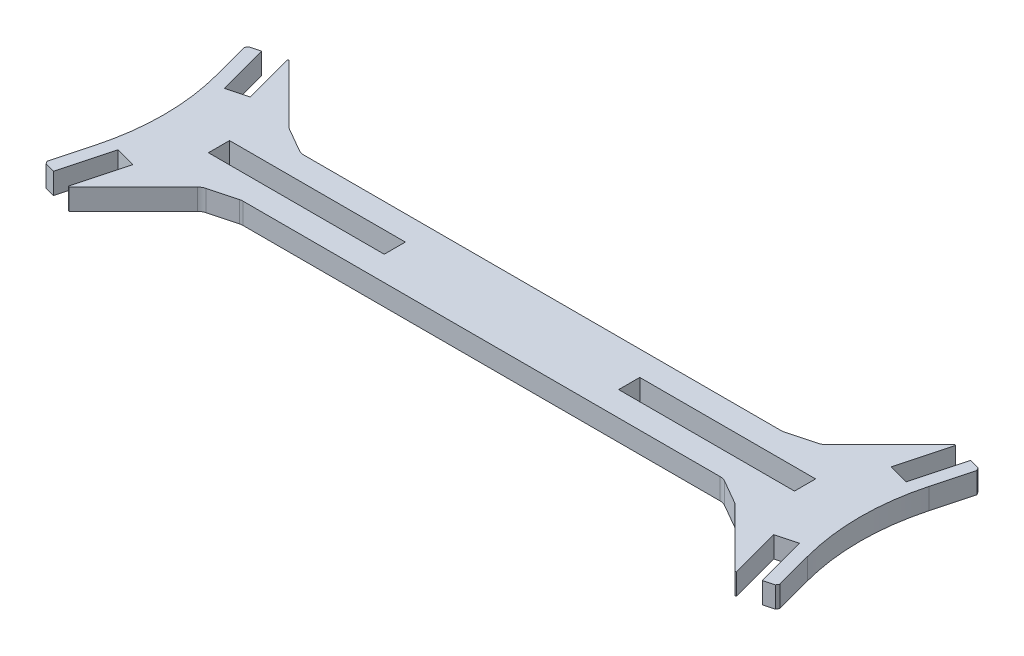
ISO-10303-21;
HEADER;
FILE_DESCRIPTION(('STEP AP214'),'2;1');
FILE_NAME('part.step','',(''),(''),'','','');
FILE_SCHEMA(('AUTOMOTIVE_DESIGN { 1 0 10303 214 1 1 1 1 }'));
ENDSEC;
DATA;
#1=APPLICATION_CONTEXT('core data for automotive mechanical design processes');
#2=APPLICATION_PROTOCOL_DEFINITION('international standard','automotive_design',2000,#1);
#3=PRODUCT_CONTEXT('',#1,'mechanical');
#4=PRODUCT('Part','Part','',(#3));
#5=PRODUCT_RELATED_PRODUCT_CATEGORY('part','',(#4));
#6=PRODUCT_DEFINITION_FORMATION('','',#4);
#7=PRODUCT_DEFINITION_CONTEXT('part definition',#1,'design');
#8=PRODUCT_DEFINITION('design','',#6,#7);
#9=PRODUCT_DEFINITION_SHAPE('','',#8);
#10=(LENGTH_UNIT() NAMED_UNIT(*) SI_UNIT(.MILLI.,.METRE.));
#11=(NAMED_UNIT(*) PLANE_ANGLE_UNIT() SI_UNIT($,.RADIAN.));
#12=(NAMED_UNIT(*) SI_UNIT($,.STERADIAN.) SOLID_ANGLE_UNIT());
#13=UNCERTAINTY_MEASURE_WITH_UNIT(LENGTH_MEASURE(1.E-05),#10,'distance_accuracy_value','');
#14=(GEOMETRIC_REPRESENTATION_CONTEXT(3) GLOBAL_UNCERTAINTY_ASSIGNED_CONTEXT((#13)) GLOBAL_UNIT_ASSIGNED_CONTEXT((#10,
#11,#12)) REPRESENTATION_CONTEXT('',''));
#15=CARTESIAN_POINT('',(0.,0.,0.));
#16=DIRECTION('',(0.,0.,1.));
#17=DIRECTION('',(1.,0.,0.));
#18=AXIS2_PLACEMENT_3D('',#15,#16,#17);
#19=CARTESIAN_POINT('',(-30.5291427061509,149.805822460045,-113.936311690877));
#20=DIRECTION('',(-0.258819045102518,0.,-0.965925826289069));
#21=DIRECTION('',(-0.965925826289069,0.,0.258819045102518));
#22=AXIS2_PLACEMENT_3D('',#19,#20,#21);
#23=PLANE('',#22);
#24=DIRECTION('',(0.,-1.,0.));
#25=VECTOR('',#24,1.);
#26=CARTESIAN_POINT('',(4.98270625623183,18.,-123.451682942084));
#27=LINE('',#26,#25);
#28=CARTESIAN_POINT('',(4.98270625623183,18.,-123.451682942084));
#29=VERTEX_POINT('',#28);
#30=CARTESIAN_POINT('',(4.98270625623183,0.,-123.451682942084));
#31=VERTEX_POINT('',#30);
#32=EDGE_CURVE('E428',#29,#31,#27,.T.);
#33=ORIENTED_EDGE('',*,*,#32,.F.);
#34=DIRECTION('',(-0.965925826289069,0.,0.258819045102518));
#35=VECTOR('',#34,1.);
#36=CARTESIAN_POINT('',(-30.5291427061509,18.,-113.936311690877));
#37=LINE('',#36,#35);
#38=CARTESIAN_POINT('',(5.94863208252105,18.,-123.710501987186));
#39=VERTEX_POINT('',#38);
#40=EDGE_CURVE('E569',#39,#29,#37,.T.);
#41=ORIENTED_EDGE('',*,*,#40,.F.);
#42=DIRECTION('',(0.,-1.,0.));
#43=VECTOR('',#42,1.);
#44=CARTESIAN_POINT('',(5.94863208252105,149.805822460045,-123.710501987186));
#45=LINE('',#44,#43);
#46=CARTESIAN_POINT('',(5.94863208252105,0.,-123.710501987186));
#47=VERTEX_POINT('',#46);
#48=EDGE_CURVE('E583',#39,#47,#45,.T.);
#49=ORIENTED_EDGE('',*,*,#48,.T.);
#50=DIRECTION('',(0.965925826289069,0.,-0.258819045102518));
#51=VECTOR('',#50,1.);
#52=CARTESIAN_POINT('',(-30.5291427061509,0.,-113.936311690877));
#53=LINE('',#52,#51);
#54=EDGE_CURVE('E577',#31,#47,#53,.T.);
#55=ORIENTED_EDGE('',*,*,#54,.F.);
#56=EDGE_LOOP('',(#33,#41,#49,#55));
#57=FACE_BOUND('',#56,.T.);
#58=ADVANCED_FACE('F37',(#57),#23,.T.);
#59=CARTESIAN_POINT('',(69.3817756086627,149.805822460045,-258.936311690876));
#60=DIRECTION('',(-0.258819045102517,0.,0.965925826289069));
#61=DIRECTION('',(0.965925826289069,0.,0.258819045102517));
#62=AXIS2_PLACEMENT_3D('',#59,#60,#61);
#63=PLANE('',#62);
#64=DIRECTION('',(0.965925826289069,0.,0.258819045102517));
#65=VECTOR('',#64,1.);
#66=CARTESIAN_POINT('',(69.3817756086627,18.,-258.936311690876));
#67=LINE('',#66,#65);
#68=CARTESIAN_POINT('',(592.403958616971,18.,-118.792940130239));
#69=VERTEX_POINT('',#68);
#70=CARTESIAN_POINT('',(601.097291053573,18.,-116.463568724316));
#71=VERTEX_POINT('',#70);
#72=EDGE_CURVE('E566',#69,#71,#67,.T.);
#73=ORIENTED_EDGE('',*,*,#72,.T.);
#74=DIRECTION('',(0.,-1.,0.));
#75=VECTOR('',#74,1.);
#76=CARTESIAN_POINT('',(601.097291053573,149.805822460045,-116.463568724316));
#77=LINE('',#76,#75);
#78=CARTESIAN_POINT('',(601.097291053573,0.,-116.463568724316));
#79=VERTEX_POINT('',#78);
#80=EDGE_CURVE('E781',#71,#79,#77,.T.);
#81=ORIENTED_EDGE('',*,*,#80,.T.);
#82=DIRECTION('',(-0.965925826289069,0.,-0.258819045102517));
#83=VECTOR('',#82,1.);
#84=CARTESIAN_POINT('',(69.3817756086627,0.,-258.936311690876));
#85=LINE('',#84,#83);
#86=CARTESIAN_POINT('',(592.403958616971,0.,-118.792940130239));
#87=VERTEX_POINT('',#86);
#88=EDGE_CURVE('E558',#79,#87,#85,.T.);
#89=ORIENTED_EDGE('',*,*,#88,.T.);
#90=DIRECTION('',(0.,-1.,0.));
#91=VECTOR('',#90,1.);
#92=CARTESIAN_POINT('',(592.403958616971,18.,-118.792940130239));
#93=LINE('',#92,#91);
#94=EDGE_CURVE('E451',#69,#87,#93,.T.);
#95=ORIENTED_EDGE('',*,*,#94,.F.);
#96=EDGE_LOOP('',(#73,#81,#89,#95));
#97=FACE_BOUND('',#96,.T.);
#98=ADVANCED_FACE('F924',(#97),#63,.F.);
#99=CARTESIAN_POINT('',(54.3817756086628,149.805822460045,202.955549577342));
#100=DIRECTION('',(0.258819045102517,0.,0.965925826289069));
#101=DIRECTION('',(0.965925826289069,0.,-0.258819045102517));
#102=AXIS2_PLACEMENT_3D('',#99,#100,#101);
#103=PLANE('',#102);
#104=DIRECTION('',(0.,-1.,0.));
#105=VECTOR('',#104,1.);
#106=CARTESIAN_POINT('',(575.017293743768,18.,63.4516829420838));
#107=LINE('',#106,#105);
#108=CARTESIAN_POINT('',(575.017293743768,18.,63.4516829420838));
#109=VERTEX_POINT('',#108);
#110=CARTESIAN_POINT('',(575.017293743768,0.,63.4516829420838));
#111=VERTEX_POINT('',#110);
#112=EDGE_CURVE('E477',#109,#111,#107,.T.);
#113=ORIENTED_EDGE('',*,*,#112,.F.);
#114=DIRECTION('',(0.965925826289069,0.,-0.258819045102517));
#115=VECTOR('',#114,1.);
#116=CARTESIAN_POINT('',(54.3817756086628,18.,202.955549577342));
#117=LINE('',#116,#115);
#118=CARTESIAN_POINT('',(574.051367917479,18.,63.7105019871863));
#119=VERTEX_POINT('',#118);
#120=EDGE_CURVE('E532',#119,#109,#117,.T.);
#121=ORIENTED_EDGE('',*,*,#120,.F.);
#122=DIRECTION('',(0.,-1.,0.));
#123=VECTOR('',#122,1.);
#124=CARTESIAN_POINT('',(574.051367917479,149.805822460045,63.7105019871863));
#125=LINE('',#124,#123);
#126=CARTESIAN_POINT('',(574.051367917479,0.,63.7105019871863));
#127=VERTEX_POINT('',#126);
#128=EDGE_CURVE('E526',#119,#127,#125,.T.);
#129=ORIENTED_EDGE('',*,*,#128,.T.);
#130=DIRECTION('',(-0.965925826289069,0.,0.258819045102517));
#131=VECTOR('',#130,1.);
#132=CARTESIAN_POINT('',(54.3817756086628,0.,202.955549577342));
#133=LINE('',#132,#131);
#134=EDGE_CURVE('E542',#111,#127,#133,.T.);
#135=ORIENTED_EDGE('',*,*,#134,.F.);
#136=EDGE_LOOP('',(#113,#121,#129,#135));
#137=FACE_BOUND('',#136,.T.);
#138=ADVANCED_FACE('F883',(#137),#103,.T.);
#139=CARTESIAN_POINT('',(-15.5291427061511,149.805822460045,57.9555495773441));
#140=DIRECTION('',(0.258819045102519,0.,-0.965925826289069));
#141=DIRECTION('',(-0.965925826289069,0.,-0.258819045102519));
#142=AXIS2_PLACEMENT_3D('',#139,#140,#141);
#143=PLANE('',#142);
#144=DIRECTION('',(-0.965925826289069,0.,-0.258819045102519));
#145=VECTOR('',#144,1.);
#146=CARTESIAN_POINT('',(-15.5291427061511,18.,57.9555495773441));
#147=LINE('',#146,#145);
#148=CARTESIAN_POINT('',(-12.4039586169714,18.,58.7929401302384));
#149=VERTEX_POINT('',#148);
#150=CARTESIAN_POINT('',(-21.0972910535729,18.,56.4635687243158));
#151=VERTEX_POINT('',#150);
#152=EDGE_CURVE('E502',#149,#151,#147,.T.);
#153=ORIENTED_EDGE('',*,*,#152,.T.);
#154=DIRECTION('',(0.,-1.,0.));
#155=VECTOR('',#154,1.);
#156=CARTESIAN_POINT('',(-21.0972910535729,149.805822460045,56.4635687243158));
#157=LINE('',#156,#155);
#158=CARTESIAN_POINT('',(-21.0972910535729,0.,56.4635687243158));
#159=VERTEX_POINT('',#158);
#160=EDGE_CURVE('E45',#151,#159,#157,.T.);
#161=ORIENTED_EDGE('',*,*,#160,.T.);
#162=DIRECTION('',(0.965925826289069,0.,0.258819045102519));
#163=VECTOR('',#162,1.);
#164=CARTESIAN_POINT('',(-15.5291427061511,0.,57.9555495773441));
#165=LINE('',#164,#163);
#166=CARTESIAN_POINT('',(-12.4039586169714,0.,58.7929401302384));
#167=VERTEX_POINT('',#166);
#168=EDGE_CURVE('E522',#159,#167,#165,.T.);
#169=ORIENTED_EDGE('',*,*,#168,.T.);
#170=DIRECTION('',(0.,-1.,0.));
#171=VECTOR('',#170,1.);
#172=CARTESIAN_POINT('',(-12.4039586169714,18.,58.7929401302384));
#173=LINE('',#172,#171);
#174=EDGE_CURVE('E503',#149,#167,#173,.T.);
#175=ORIENTED_EDGE('',*,*,#174,.F.);
#176=EDGE_LOOP('',(#153,#161,#169,#175));
#177=FACE_BOUND('',#176,.T.);
#178=ADVANCED_FACE('F814',(#177),#143,.F.);
#179=CARTESIAN_POINT('',(0.,18.,0.));
#180=DIRECTION('',(0.,0.,-1.));
#181=DIRECTION('',(-1.,0.,0.));
#182=AXIS2_PLACEMENT_3D('',#179,#180,#181);
#183=PLANE('',#182);
#184=DIRECTION('',(1.,0.,0.));
#185=VECTOR('',#184,1.);
#186=CARTESIAN_POINT('',(0.,18.,0.));
#187=LINE('',#186,#185);
#188=CARTESIAN_POINT('',(90.294175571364,18.,0.));
#189=VERTEX_POINT('',#188);
#190=CARTESIAN_POINT('',(497.661374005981,18.,0.));
#191=VERTEX_POINT('',#190);
#192=EDGE_CURVE('E652',#189,#191,#187,.T.);
#193=ORIENTED_EDGE('',*,*,#192,.F.);
#194=DIRECTION('',(0.,1.,0.));
#195=VECTOR('',#194,1.);
#196=CARTESIAN_POINT('',(90.294175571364,0.,0.));
#197=LINE('',#196,#195);
#198=CARTESIAN_POINT('',(90.294175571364,0.,0.));
#199=VERTEX_POINT('',#198);
#200=EDGE_CURVE('E732',#189,#199,#197,.F.);
#201=ORIENTED_EDGE('',*,*,#200,.T.);
#202=DIRECTION('',(1.,0.,0.));
#203=VECTOR('',#202,1.);
#204=CARTESIAN_POINT('',(0.,0.,0.));
#205=LINE('',#204,#203);
#206=CARTESIAN_POINT('',(497.661374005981,0.,0.));
#207=VERTEX_POINT('',#206);
#208=EDGE_CURVE('E615',#199,#207,#205,.T.);
#209=ORIENTED_EDGE('',*,*,#208,.T.);
#210=DIRECTION('',(0.,1.,0.));
#211=VECTOR('',#210,1.);
#212=CARTESIAN_POINT('',(497.661374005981,18.,0.));
#213=LINE('',#212,#211);
#214=EDGE_CURVE('E729',#207,#191,#213,.T.);
#215=ORIENTED_EDGE('',*,*,#214,.T.);
#216=EDGE_LOOP('',(#193,#201,#209,#215));
#217=FACE_BOUND('',#216,.T.);
#218=ADVANCED_FACE('F858',(#217),#183,.F.);
#219=CARTESIAN_POINT('',(0.,18.,-60.));
#220=DIRECTION('',(0.,0.,1.));
#221=DIRECTION('',(1.,0.,0.));
#222=AXIS2_PLACEMENT_3D('',#219,#220,#221);
#223=PLANE('',#222);
#224=DIRECTION('',(-1.,0.,0.));
#225=VECTOR('',#224,1.);
#226=CARTESIAN_POINT('',(0.,0.,-60.));
#227=LINE('',#226,#225);
#228=CARTESIAN_POINT('',(489.705824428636,0.,-60.));
#229=VERTEX_POINT('',#228);
#230=CARTESIAN_POINT('',(82.3386259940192,0.,-60.));
#231=VERTEX_POINT('',#230);
#232=EDGE_CURVE('E656',#229,#231,#227,.T.);
#233=ORIENTED_EDGE('',*,*,#232,.T.);
#234=DIRECTION('',(0.,1.,0.));
#235=VECTOR('',#234,1.);
#236=CARTESIAN_POINT('',(82.3386259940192,18.,-60.));
#237=LINE('',#236,#235);
#238=CARTESIAN_POINT('',(82.3386259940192,18.,-60.));
#239=VERTEX_POINT('',#238);
#240=EDGE_CURVE('E719',#231,#239,#237,.T.);
#241=ORIENTED_EDGE('',*,*,#240,.T.);
#242=DIRECTION('',(-1.,0.,0.));
#243=VECTOR('',#242,1.);
#244=CARTESIAN_POINT('',(0.,18.,-60.));
#245=LINE('',#244,#243);
#246=CARTESIAN_POINT('',(489.705824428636,18.,-60.));
#247=VERTEX_POINT('',#246);
#248=EDGE_CURVE('E655',#247,#239,#245,.T.);
#249=ORIENTED_EDGE('',*,*,#248,.F.);
#250=DIRECTION('',(0.,1.,0.));
#251=VECTOR('',#250,1.);
#252=CARTESIAN_POINT('',(489.705824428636,0.,-60.));
#253=LINE('',#252,#251);
#254=EDGE_CURVE('E716',#247,#229,#253,.F.);
#255=ORIENTED_EDGE('',*,*,#254,.T.);
#256=EDGE_LOOP('',(#233,#241,#249,#255));
#257=FACE_BOUND('',#256,.T.);
#258=ADVANCED_FACE('F963',(#257),#223,.F.);
#259=CARTESIAN_POINT('',(0.,18.,0.));
#260=DIRECTION('',(0.,-1.,0.));
#261=DIRECTION('',(0.,0.,-1.));
#262=AXIS2_PLACEMENT_3D('',#259,#260,#261);
#263=PLANE('',#262);
#264=DIRECTION('',(-0.258819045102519,0.,0.965925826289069));
#265=VECTOR('',#264,1.);
#266=CARTESIAN_POINT('',(533.647367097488,18.,142.990381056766));
#267=LINE('',#266,#265);
#268=CARTESIAN_POINT('',(602.511504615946,18.,-114.014078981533));
#269=VERTEX_POINT('',#268);
#270=CARTESIAN_POINT('',(593.870070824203,18.,-81.7638090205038));
#271=VERTEX_POINT('',#270);
#272=EDGE_CURVE('E549',#269,#271,#267,.T.);
#273=ORIENTED_EDGE('',*,*,#272,.F.);
#274=DIRECTION('',(0.500000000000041,0.,0.866025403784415));
#275=VECTOR('',#274,1.);
#276=CARTESIAN_POINT('',(601.097291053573,18.,-116.463568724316));
#277=LINE('',#276,#275);
#278=EDGE_CURVE('E799',#269,#71,#277,.F.);
#279=ORIENTED_EDGE('',*,*,#278,.T.);
#280=ORIENTED_EDGE('',*,*,#72,.F.);
#281=DIRECTION('',(-0.258819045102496,0.,0.965925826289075));
#282=VECTOR('',#281,1.);
#283=CARTESIAN_POINT('',(523.022183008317,18.,140.143371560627));
#284=LINE('',#283,#282);
#285=CARTESIAN_POINT('',(580.757101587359,18.,-75.32627794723));
#286=VERTEX_POINT('',#285);
#287=EDGE_CURVE('E438',#69,#286,#284,.T.);
#288=ORIENTED_EDGE('',*,*,#287,.T.);
#289=DIRECTION('',(-0.965925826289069,0.,-0.25881904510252));
#290=VECTOR('',#289,1.);
#291=CARTESIAN_POINT('',(57.7349185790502,18.,-215.469649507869));
#292=LINE('',#291,#290);
#293=CARTESIAN_POINT('',(563.370436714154,18.,-79.9850207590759));
#294=VERTEX_POINT('',#293);
#295=EDGE_CURVE('E431',#286,#294,#292,.T.);
#296=ORIENTED_EDGE('',*,*,#295,.T.);
#297=DIRECTION('',(0.258819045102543,0.,-0.965925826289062));
#298=VECTOR('',#297,1.);
#299=CARTESIAN_POINT('',(505.635518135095,18.,135.484628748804));
#300=LINE('',#299,#298);
#301=CARTESIAN_POINT('',(575.017293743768,18.,-123.451682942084));
#302=VERTEX_POINT('',#301);
#303=EDGE_CURVE('E434',#294,#302,#300,.T.);
#304=ORIENTED_EDGE('',*,*,#303,.T.);
#305=CARTESIAN_POINT('',(574.051367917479,18.,-123.710501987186));
#306=VERTEX_POINT('',#305);
#307=EDGE_CURVE('E552',#306,#302,#67,.T.);
#308=ORIENTED_EDGE('',*,*,#307,.F.);
#309=DIRECTION('',(0.707106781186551,0.,-0.707106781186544));
#310=VECTOR('',#309,1.);
#311=CARTESIAN_POINT('',(225.170432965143,18.,225.170432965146));
#312=LINE('',#311,#310);
#313=CARTESIAN_POINT('',(519.306620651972,18.,-68.9657547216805));
#314=VERTEX_POINT('',#313);
#315=EDGE_CURVE('E551',#314,#306,#312,.T.);
#316=ORIENTED_EDGE('',*,*,#315,.F.);
#317=CARTESIAN_POINT('',(512.235552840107,18.,-76.0368225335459));
#318=DIRECTION('',(0.,-1.,0.));
#319=DIRECTION('',(0.,0.,-1.));
#320=AXIS2_PLACEMENT_3D('',#317,#318,#319);
#321=CIRCLE('',#320,10.);
#322=CARTESIAN_POINT('',(514.823743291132,18.,-66.3775642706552));
#323=VERTEX_POINT('',#322);
#324=EDGE_CURVE('E769',#314,#323,#321,.T.);
#325=ORIENTED_EDGE('',*,*,#324,.T.);
#326=DIRECTION('',(0.96592582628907,0.,-0.258819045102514));
#327=VECTOR('',#326,1.);
#328=CARTESIAN_POINT('',(17.8922604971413,18.,66.774825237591));
#329=LINE('',#328,#327);
#330=CARTESIAN_POINT('',(492.294014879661,18.,-60.3407417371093));
#331=VERTEX_POINT('',#330);
#332=EDGE_CURVE('E694',#323,#331,#329,.F.);
#333=ORIENTED_EDGE('',*,*,#332,.T.);
#334=CARTESIAN_POINT('',(489.705824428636,18.,-70.));
#335=DIRECTION('',(0.,-1.,0.));
#336=DIRECTION('',(0.,0.,-1.));
#337=AXIS2_PLACEMENT_3D('',#334,#335,#336);
#338=CIRCLE('',#337,10.);
#339=EDGE_CURVE('E767',#331,#247,#338,.T.);
#340=ORIENTED_EDGE('',*,*,#339,.T.);
#341=ORIENTED_EDGE('',*,*,#248,.T.);
#342=CARTESIAN_POINT('',(82.3386259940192,18.,-70.));
#343=DIRECTION('',(0.,-1.,0.));
#344=DIRECTION('',(0.,0.,-1.));
#345=AXIS2_PLACEMENT_3D('',#342,#343,#344);
#346=CIRCLE('',#345,10.);
#347=CARTESIAN_POINT('',(77.3386259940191,18.,-61.3397459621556));
#348=VERTEX_POINT('',#347);
#349=EDGE_CURVE('E753',#239,#348,#346,.T.);
#350=ORIENTED_EDGE('',*,*,#349,.T.);
#351=DIRECTION('',(-0.866025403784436,0.,-0.500000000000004));
#352=VECTOR('',#351,1.);
#353=CARTESIAN_POINT('',(45.8955456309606,18.,-79.4934168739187));
#354=LINE('',#353,#352);
#355=CARTESIAN_POINT('',(57.1390241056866,18.,-73.0019915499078));
#356=VERTEX_POINT('',#355);
#357=EDGE_CURVE('E688',#348,#356,#354,.T.);
#358=ORIENTED_EDGE('',*,*,#357,.T.);
#359=CARTESIAN_POINT('',(62.1390241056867,18.,-81.6622455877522));
#360=DIRECTION('',(0.,-1.,0.));
#361=DIRECTION('',(0.,0.,-1.));
#362=AXIS2_PLACEMENT_3D('',#359,#360,#361);
#363=CIRCLE('',#362,10.);
#364=CARTESIAN_POINT('',(55.0679562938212,18.,-74.5911777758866));
#365=VERTEX_POINT('',#364);
#366=EDGE_CURVE('E751',#356,#365,#363,.T.);
#367=ORIENTED_EDGE('',*,*,#366,.T.);
#368=DIRECTION('',(-0.707106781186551,0.,-0.707106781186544));
#369=VECTOR('',#368,1.);
#370=CARTESIAN_POINT('',(64.8295670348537,18.,-64.8295670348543));
#371=LINE('',#370,#369);
#372=EDGE_CURVE('E571',#365,#39,#371,.T.);
#373=ORIENTED_EDGE('',*,*,#372,.T.);
#374=ORIENTED_EDGE('',*,*,#40,.T.);
#375=DIRECTION('',(0.258819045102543,0.,0.965925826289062));
#376=VECTOR('',#375,1.);
#377=CARTESIAN_POINT('',(35.5118489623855,18.,-9.51537125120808));
#378=LINE('',#377,#376);
#379=CARTESIAN_POINT('',(16.6295632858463,18.,-79.9850207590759));
#380=VERTEX_POINT('',#379);
#381=EDGE_CURVE('E401',#29,#380,#378,.T.);
#382=ORIENTED_EDGE('',*,*,#381,.T.);
#383=DIRECTION('',(0.965925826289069,0.,-0.258819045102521));
#384=VECTOR('',#383,1.);
#385=CARTESIAN_POINT('',(-18.8822856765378,18.,-70.4696495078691));
#386=LINE('',#385,#384);
#387=CARTESIAN_POINT('',(-0.757101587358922,18.,-75.32627794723));
#388=VERTEX_POINT('',#387);
#389=EDGE_CURVE('E393',#388,#380,#386,.T.);
#390=ORIENTED_EDGE('',*,*,#389,.F.);
#391=DIRECTION('',(-0.258819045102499,0.,-0.965925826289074));
#392=VECTOR('',#391,1.);
#393=CARTESIAN_POINT('',(18.1251840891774,18.,-4.85662843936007));
#394=LINE('',#393,#392);
#395=CARTESIAN_POINT('',(-12.4039586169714,18.,-118.792940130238));
#396=VERTEX_POINT('',#395);
#397=EDGE_CURVE('E404',#388,#396,#394,.T.);
#398=ORIENTED_EDGE('',*,*,#397,.T.);
#399=CARTESIAN_POINT('',(-21.097291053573,18.,-116.463568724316));
#400=VERTEX_POINT('',#399);
#401=EDGE_CURVE('E572',#396,#400,#37,.T.);
#402=ORIENTED_EDGE('',*,*,#401,.T.);
#403=DIRECTION('',(0.500000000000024,0.,-0.866025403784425));
#404=VECTOR('',#403,1.);
#405=CARTESIAN_POINT('',(-22.5115046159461,18.,-114.014078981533));
#406=LINE('',#405,#404);
#407=CARTESIAN_POINT('',(-22.5115046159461,18.,-114.014078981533));
#408=VERTEX_POINT('',#407);
#409=EDGE_CURVE('E795',#400,#408,#406,.F.);
#410=ORIENTED_EDGE('',*,*,#409,.T.);
#411=DIRECTION('',(0.258819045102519,0.,0.965925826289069));
#412=VECTOR('',#411,1.);
#413=CARTESIAN_POINT('',(7.49999999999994,18.,-2.00961894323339));
#414=LINE('',#413,#412);
#415=CARTESIAN_POINT('',(-13.8700708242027,18.,-81.7638090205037));
#416=VERTEX_POINT('',#415);
#417=EDGE_CURVE('E574',#408,#416,#414,.T.);
#418=ORIENTED_EDGE('',*,*,#417,.T.);
#419=CARTESIAN_POINT('',(-207.055236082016,18.,-30.));
#420=DIRECTION('',(0.,-1.,0.));
#421=DIRECTION('',(0.,0.,-1.));
#422=AXIS2_PLACEMENT_3D('',#419,#420,#421);
#423=CIRCLE('',#422,200.);
#424=CARTESIAN_POINT('',(-13.8700708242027,18.,21.7638090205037));
#425=VERTEX_POINT('',#424);
#426=EDGE_CURVE('E677',#416,#425,#423,.T.);
#427=ORIENTED_EDGE('',*,*,#426,.T.);
#428=DIRECTION('',(0.258819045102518,0.,-0.965925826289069));
#429=VECTOR('',#428,1.);
#430=CARTESIAN_POINT('',(-7.49999999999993,18.,-2.00961894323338));
#431=LINE('',#430,#429);
#432=CARTESIAN_POINT('',(-22.511504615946,18.,54.0140789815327));
#433=VERTEX_POINT('',#432);
#434=EDGE_CURVE('E521',#433,#425,#431,.T.);
#435=ORIENTED_EDGE('',*,*,#434,.F.);
#436=DIRECTION('',(-0.499999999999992,0.,-0.866025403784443));
#437=VECTOR('',#436,1.);
#438=CARTESIAN_POINT('',(-21.0972910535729,18.,56.4635687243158));
#439=LINE('',#438,#437);
#440=EDGE_CURVE('E52',#433,#151,#439,.F.);
#441=ORIENTED_EDGE('',*,*,#440,.T.);
#442=ORIENTED_EDGE('',*,*,#152,.F.);
#443=DIRECTION('',(0.258819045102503,0.,-0.965925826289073));
#444=VECTOR('',#443,1.);
#445=CARTESIAN_POINT('',(3.12518408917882,18.,0.837390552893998));
#446=LINE('',#445,#444);
#447=CARTESIAN_POINT('',(-0.75710158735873,18.,15.3262779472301));
#448=VERTEX_POINT('',#447);
#449=EDGE_CURVE('E490',#149,#448,#446,.T.);
#450=ORIENTED_EDGE('',*,*,#449,.T.);
#451=DIRECTION('',(0.965925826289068,0.,0.258819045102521));
#452=VECTOR('',#451,1.);
#453=CARTESIAN_POINT('',(-3.88228567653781,18.,14.488887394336));
#454=LINE('',#453,#452);
#455=CARTESIAN_POINT('',(16.6295632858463,18.,19.985020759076));
#456=VERTEX_POINT('',#455);
#457=EDGE_CURVE('E483',#448,#456,#454,.T.);
#458=ORIENTED_EDGE('',*,*,#457,.T.);
#459=DIRECTION('',(-0.258819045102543,0.,0.965925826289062));
#460=VECTOR('',#459,1.);
#461=CARTESIAN_POINT('',(20.5118489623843,18.,5.49613336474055));
#462=LINE('',#461,#460);
#463=CARTESIAN_POINT('',(4.98270625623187,18.,63.4516829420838));
#464=VERTEX_POINT('',#463);
#465=EDGE_CURVE('E486',#456,#464,#462,.T.);
#466=ORIENTED_EDGE('',*,*,#465,.T.);
#467=CARTESIAN_POINT('',(5.94863208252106,18.,63.7105019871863));
#468=VERTEX_POINT('',#467);
#469=EDGE_CURVE('E510',#468,#464,#147,.T.);
#470=ORIENTED_EDGE('',*,*,#469,.F.);
#471=DIRECTION('',(-0.707106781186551,0.,0.707106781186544));
#472=VECTOR('',#471,1.);
#473=CARTESIAN_POINT('',(34.8295670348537,18.,34.829567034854));
#474=LINE('',#473,#472);
#475=CARTESIAN_POINT('',(60.6933793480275,18.,8.96575472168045));
#476=VERTEX_POINT('',#475);
#477=EDGE_CURVE('E518',#476,#468,#474,.T.);
#478=ORIENTED_EDGE('',*,*,#477,.F.);
#479=CARTESIAN_POINT('',(67.7644471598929,18.,16.036822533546));
#480=DIRECTION('',(0.,-1.,0.));
#481=DIRECTION('',(0.,0.,-1.));
#482=AXIS2_PLACEMENT_3D('',#479,#480,#481);
#483=CIRCLE('',#482,10.);
#484=CARTESIAN_POINT('',(65.1762567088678,18.,6.37756427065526));
#485=VERTEX_POINT('',#484);
#486=EDGE_CURVE('E757',#476,#485,#483,.T.);
#487=ORIENTED_EDGE('',*,*,#486,.T.);
#488=DIRECTION('',(-0.965925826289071,0.,0.258819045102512));
#489=VECTOR('',#488,1.);
#490=CARTESIAN_POINT('',(5.96037240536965,18.,22.2444126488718));
#491=LINE('',#490,#489);
#492=CARTESIAN_POINT('',(87.7059851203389,18.,0.340741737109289));
#493=VERTEX_POINT('',#492);
#494=EDGE_CURVE('E706',#485,#493,#491,.F.);
#495=ORIENTED_EDGE('',*,*,#494,.T.);
#496=CARTESIAN_POINT('',(90.294175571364,18.,10.));
#497=DIRECTION('',(0.,-1.,0.));
#498=DIRECTION('',(0.,0.,-1.));
#499=AXIS2_PLACEMENT_3D('',#496,#497,#498);
#500=CIRCLE('',#499,10.);
#501=EDGE_CURVE('E763',#493,#189,#500,.T.);
#502=ORIENTED_EDGE('',*,*,#501,.T.);
#503=ORIENTED_EDGE('',*,*,#192,.T.);
#504=CARTESIAN_POINT('',(497.661374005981,18.,10.));
#505=DIRECTION('',(0.,-1.,0.));
#506=DIRECTION('',(0.,0.,-1.));
#507=AXIS2_PLACEMENT_3D('',#504,#505,#506);
#508=CIRCLE('',#507,10.);
#509=CARTESIAN_POINT('',(502.661374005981,18.,1.33974596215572));
#510=VERTEX_POINT('',#509);
#511=EDGE_CURVE('E773',#191,#510,#508,.T.);
#512=ORIENTED_EDGE('',*,*,#511,.T.);
#513=DIRECTION('',(0.866025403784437,0.,0.500000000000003));
#514=VECTOR('',#513,1.);
#515=CARTESIAN_POINT('',(125.085216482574,18.,-216.653950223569));
#516=LINE('',#515,#514);
#517=CARTESIAN_POINT('',(522.860975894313,18.,13.0019915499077));
#518=VERTEX_POINT('',#517);
#519=EDGE_CURVE('E700',#510,#518,#516,.T.);
#520=ORIENTED_EDGE('',*,*,#519,.T.);
#521=CARTESIAN_POINT('',(517.860975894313,18.,21.6622455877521));
#522=DIRECTION('',(0.,-1.,0.));
#523=DIRECTION('',(0.,0.,-1.));
#524=AXIS2_PLACEMENT_3D('',#521,#522,#523);
#525=CIRCLE('',#524,10.);
#526=CARTESIAN_POINT('',(524.932043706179,18.,14.5911777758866));
#527=VERTEX_POINT('',#526);
#528=EDGE_CURVE('E779',#518,#527,#525,.T.);
#529=ORIENTED_EDGE('',*,*,#528,.T.);
#530=DIRECTION('',(0.707106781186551,0.,0.707106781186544));
#531=VECTOR('',#530,1.);
#532=CARTESIAN_POINT('',(255.170432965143,18.,-255.170432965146));
#533=LINE('',#532,#531);
#534=EDGE_CURVE('E539',#527,#119,#533,.T.);
#535=ORIENTED_EDGE('',*,*,#534,.T.);
#536=ORIENTED_EDGE('',*,*,#120,.T.);
#537=DIRECTION('',(-0.258819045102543,0.,-0.965925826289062));
#538=VECTOR('',#537,1.);
#539=CARTESIAN_POINT('',(520.635518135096,18.,-139.503866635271));
#540=LINE('',#539,#538);
#541=CARTESIAN_POINT('',(563.370436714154,18.,19.985020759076));
#542=VERTEX_POINT('',#541);
#543=EDGE_CURVE('E464',#109,#542,#540,.T.);
#544=ORIENTED_EDGE('',*,*,#543,.T.);
#545=DIRECTION('',(-0.965925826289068,0.,0.25881904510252));
#546=VECTOR('',#545,1.);
#547=CARTESIAN_POINT('',(42.7349185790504,18.,159.488887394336));
#548=LINE('',#547,#546);
#549=CARTESIAN_POINT('',(580.757101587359,18.,15.3262779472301));
#550=VERTEX_POINT('',#549);
#551=EDGE_CURVE('E458',#550,#542,#548,.T.);
#552=ORIENTED_EDGE('',*,*,#551,.F.);
#553=DIRECTION('',(0.258819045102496,0.,0.965925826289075));
#554=VECTOR('',#553,1.);
#555=CARTESIAN_POINT('',(538.022183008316,18.,-144.162609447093));
#556=LINE('',#555,#554);
#557=CARTESIAN_POINT('',(592.403958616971,18.,58.7929401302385));
#558=VERTEX_POINT('',#557);
#559=EDGE_CURVE('E460',#550,#558,#556,.T.);
#560=ORIENTED_EDGE('',*,*,#559,.T.);
#561=CARTESIAN_POINT('',(601.097291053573,18.,56.4635687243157));
#562=VERTEX_POINT('',#561);
#563=EDGE_CURVE('E546',#558,#562,#117,.T.);
#564=ORIENTED_EDGE('',*,*,#563,.T.);
#565=DIRECTION('',(-0.49999999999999,0.,0.866025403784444));
#566=VECTOR('',#565,1.);
#567=CARTESIAN_POINT('',(602.511504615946,18.,54.0140789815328));
#568=LINE('',#567,#566);
#569=CARTESIAN_POINT('',(602.511504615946,18.,54.0140789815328));
#570=VERTEX_POINT('',#569);
#571=EDGE_CURVE('E797',#562,#570,#568,.F.);
#572=ORIENTED_EDGE('',*,*,#571,.T.);
#573=DIRECTION('',(-0.258819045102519,0.,-0.965925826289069));
#574=VECTOR('',#573,1.);
#575=CARTESIAN_POINT('',(548.647367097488,18.,-147.009618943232));
#576=LINE('',#575,#574);
#577=CARTESIAN_POINT('',(593.870070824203,18.,21.7638090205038));
#578=VERTEX_POINT('',#577);
#579=EDGE_CURVE('E529',#570,#578,#576,.T.);
#580=ORIENTED_EDGE('',*,*,#579,.T.);
#581=CARTESIAN_POINT('',(787.055236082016,18.,-30.));
#582=DIRECTION('',(0.,-1.,0.));
#583=DIRECTION('',(0.,0.,-1.));
#584=AXIS2_PLACEMENT_3D('',#581,#582,#583);
#585=CIRCLE('',#584,200.);
#586=EDGE_CURVE('E682',#578,#271,#585,.T.);
#587=ORIENTED_EDGE('',*,*,#586,.T.);
#588=EDGE_LOOP('',(#273,#279,#280,#288,#296,#304,#308,#316,#325,#333,#340,#341,#350,#358,#367,
#373,#374,#382,#390,#398,#402,#410,#418,#427,#435,#441,#442,#450,#458,#466,#470,#478,#487,#495,
#502,#503,#512,#520,#529,#535,#536,#544,#552,#560,#564,#572,#580,#587));
#589=FACE_BOUND('',#588,.T.);
#590=DIRECTION('',(1.,0.,0.));
#591=VECTOR('',#590,1.);
#592=CARTESIAN_POINT('',(40.,18.,-21.0000000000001));
#593=LINE('',#592,#591);
#594=CARTESIAN_POINT('',(40.,18.,-21.0000000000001));
#595=VERTEX_POINT('',#594);
#596=CARTESIAN_POINT('',(190.,18.,-21.0000000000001));
#597=VERTEX_POINT('',#596);
#598=EDGE_CURVE('E604',#595,#597,#593,.T.);
#599=ORIENTED_EDGE('',*,*,#598,.F.);
#600=DIRECTION('',(0.,0.,1.));
#601=VECTOR('',#600,1.);
#602=CARTESIAN_POINT('',(40.,18.,-38.9999999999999));
#603=LINE('',#602,#601);
#604=CARTESIAN_POINT('',(40.,18.,-38.9999999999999));
#605=VERTEX_POINT('',#604);
#606=EDGE_CURVE('E602',#605,#595,#603,.T.);
#607=ORIENTED_EDGE('',*,*,#606,.F.);
#608=DIRECTION('',(-1.,0.,0.));
#609=VECTOR('',#608,1.);
#610=CARTESIAN_POINT('',(40.,18.,-38.9999999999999));
#611=LINE('',#610,#609);
#612=CARTESIAN_POINT('',(190.,18.,-38.9999999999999));
#613=VERTEX_POINT('',#612);
#614=EDGE_CURVE('E592',#613,#605,#611,.T.);
#615=ORIENTED_EDGE('',*,*,#614,.F.);
#616=DIRECTION('',(0.,0.,-1.));
#617=VECTOR('',#616,1.);
#618=CARTESIAN_POINT('',(190.,18.,-38.9999999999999));
#619=LINE('',#618,#617);
#620=EDGE_CURVE('E608',#597,#613,#619,.T.);
#621=ORIENTED_EDGE('',*,*,#620,.F.);
#622=EDGE_LOOP('',(#599,#607,#615,#621));
#623=FACE_BOUND('',#622,.T.);
#624=DIRECTION('',(1.,0.,0.));
#625=VECTOR('',#624,1.);
#626=CARTESIAN_POINT('',(390.,18.,-21.0000000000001));
#627=LINE('',#626,#625);
#628=CARTESIAN_POINT('',(390.,18.,-21.0000000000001));
#629=VERTEX_POINT('',#628);
#630=CARTESIAN_POINT('',(540.,18.,-21.0000000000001));
#631=VERTEX_POINT('',#630);
#632=EDGE_CURVE('E637',#629,#631,#627,.T.);
#633=ORIENTED_EDGE('',*,*,#632,.F.);
#634=DIRECTION('',(0.,0.,1.));
#635=VECTOR('',#634,1.);
#636=CARTESIAN_POINT('',(390.,18.,-39.));
#637=LINE('',#636,#635);
#638=CARTESIAN_POINT('',(390.,18.,-39.));
#639=VERTEX_POINT('',#638);
#640=EDGE_CURVE('E587',#639,#629,#637,.T.);
#641=ORIENTED_EDGE('',*,*,#640,.F.);
#642=DIRECTION('',(-1.,0.,0.));
#643=VECTOR('',#642,1.);
#644=CARTESIAN_POINT('',(390.,18.,-39.));
#645=LINE('',#644,#643);
#646=CARTESIAN_POINT('',(540.,18.,-39.0000000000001));
#647=VERTEX_POINT('',#646);
#648=EDGE_CURVE('E626',#647,#639,#645,.T.);
#649=ORIENTED_EDGE('',*,*,#648,.F.);
#650=DIRECTION('',(0.,0.,-1.));
#651=VECTOR('',#650,1.);
#652=CARTESIAN_POINT('',(540.,18.,-39.0000000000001));
#653=LINE('',#652,#651);
#654=EDGE_CURVE('E640',#631,#647,#653,.T.);
#655=ORIENTED_EDGE('',*,*,#654,.F.);
#656=EDGE_LOOP('',(#633,#641,#649,#655));
#657=FACE_BOUND('',#656,.T.);
#658=ADVANCED_FACE('F412',(#589,#623,#657),#263,.F.);
#659=CARTESIAN_POINT('',(0.,0.,0.));
#660=DIRECTION('',(0.,-1.,0.));
#661=DIRECTION('',(0.,0.,-1.));
#662=AXIS2_PLACEMENT_3D('',#659,#660,#661);
#663=PLANE('',#662);
#664=ORIENTED_EDGE('',*,*,#88,.F.);
#665=DIRECTION('',(-0.500000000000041,0.,-0.866025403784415));
#666=VECTOR('',#665,1.);
#667=CARTESIAN_POINT('',(501.253172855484,0.,-289.398654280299));
#668=LINE('',#667,#666);
#669=CARTESIAN_POINT('',(602.511504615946,0.,-114.014078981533));
#670=VERTEX_POINT('',#669);
#671=EDGE_CURVE('E790',#79,#670,#668,.F.);
#672=ORIENTED_EDGE('',*,*,#671,.T.);
#673=DIRECTION('',(0.258819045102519,0.,-0.965925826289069));
#674=VECTOR('',#673,1.);
#675=CARTESIAN_POINT('',(533.647367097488,0.,142.990381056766));
#676=LINE('',#675,#674);
#677=CARTESIAN_POINT('',(593.870070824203,0.,-81.7638090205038));
#678=VERTEX_POINT('',#677);
#679=EDGE_CURVE('E560',#678,#670,#676,.T.);
#680=ORIENTED_EDGE('',*,*,#679,.F.);
#681=CARTESIAN_POINT('',(787.055236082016,0.,-30.));
#682=DIRECTION('',(0.,-1.,0.));
#683=DIRECTION('',(0.,0.,-1.));
#684=AXIS2_PLACEMENT_3D('',#681,#682,#683);
#685=CIRCLE('',#684,200.);
#686=CARTESIAN_POINT('',(593.870070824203,0.,21.7638090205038));
#687=VERTEX_POINT('',#686);
#688=EDGE_CURVE('E680',#678,#687,#685,.F.);
#689=ORIENTED_EDGE('',*,*,#688,.T.);
#690=DIRECTION('',(0.258819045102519,0.,0.965925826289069));
#691=VECTOR('',#690,1.);
#692=CARTESIAN_POINT('',(548.647367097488,0.,-147.009618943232));
#693=LINE('',#692,#691);
#694=CARTESIAN_POINT('',(602.511504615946,0.,54.0140789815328));
#695=VERTEX_POINT('',#694);
#696=EDGE_CURVE('E535',#687,#695,#693,.T.);
#697=ORIENTED_EDGE('',*,*,#696,.T.);
#698=DIRECTION('',(0.49999999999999,0.,-0.866025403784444));
#699=VECTOR('',#698,1.);
#700=CARTESIAN_POINT('',(475.272410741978,0.,274.398654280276));
#701=LINE('',#700,#699);
#702=CARTESIAN_POINT('',(601.097291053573,0.,56.4635687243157));
#703=VERTEX_POINT('',#702);
#704=EDGE_CURVE('E788',#695,#703,#701,.F.);
#705=ORIENTED_EDGE('',*,*,#704,.T.);
#706=CARTESIAN_POINT('',(592.403958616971,0.,58.7929401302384));
#707=VERTEX_POINT('',#706);
#708=EDGE_CURVE('E540',#703,#707,#133,.T.);
#709=ORIENTED_EDGE('',*,*,#708,.T.);
#710=DIRECTION('',(0.258819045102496,0.,0.965925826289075));
#711=VECTOR('',#710,1.);
#712=CARTESIAN_POINT('',(538.022183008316,0.,-144.162609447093));
#713=LINE('',#712,#711);
#714=CARTESIAN_POINT('',(580.757101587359,0.,15.3262779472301));
#715=VERTEX_POINT('',#714);
#716=EDGE_CURVE('E471',#715,#707,#713,.T.);
#717=ORIENTED_EDGE('',*,*,#716,.F.);
#718=DIRECTION('',(-0.965925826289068,0.,0.25881904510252));
#719=VECTOR('',#718,1.);
#720=CARTESIAN_POINT('',(42.7349185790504,0.,159.488887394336));
#721=LINE('',#720,#719);
#722=CARTESIAN_POINT('',(563.370436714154,0.,19.985020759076));
#723=VERTEX_POINT('',#722);
#724=EDGE_CURVE('E468',#715,#723,#721,.T.);
#725=ORIENTED_EDGE('',*,*,#724,.T.);
#726=DIRECTION('',(-0.258819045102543,0.,-0.965925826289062));
#727=VECTOR('',#726,1.);
#728=CARTESIAN_POINT('',(520.635518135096,0.,-139.503866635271));
#729=LINE('',#728,#727);
#730=EDGE_CURVE('E461',#111,#723,#729,.T.);
#731=ORIENTED_EDGE('',*,*,#730,.F.);
#732=ORIENTED_EDGE('',*,*,#134,.T.);
#733=DIRECTION('',(-0.707106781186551,0.,-0.707106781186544));
#734=VECTOR('',#733,1.);
#735=CARTESIAN_POINT('',(255.170432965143,0.,-255.170432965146));
#736=LINE('',#735,#734);
#737=CARTESIAN_POINT('',(524.932043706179,0.,14.5911777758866));
#738=VERTEX_POINT('',#737);
#739=EDGE_CURVE('E536',#127,#738,#736,.T.);
#740=ORIENTED_EDGE('',*,*,#739,.T.);
#741=CARTESIAN_POINT('',(517.860975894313,0.,21.6622455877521));
#742=DIRECTION('',(0.,-1.,0.));
#743=DIRECTION('',(0.,0.,-1.));
#744=AXIS2_PLACEMENT_3D('',#741,#742,#743);
#745=CIRCLE('',#744,10.);
#746=CARTESIAN_POINT('',(522.860975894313,0.,13.0019915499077));
#747=VERTEX_POINT('',#746);
#748=EDGE_CURVE('E777',#738,#747,#745,.F.);
#749=ORIENTED_EDGE('',*,*,#748,.T.);
#750=DIRECTION('',(-0.866025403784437,0.,-0.500000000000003));
#751=VECTOR('',#750,1.);
#752=CARTESIAN_POINT('',(524.001119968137,0.,13.6602540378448));
#753=LINE('',#752,#751);
#754=CARTESIAN_POINT('',(502.661374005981,0.,1.33974596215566));
#755=VERTEX_POINT('',#754);
#756=EDGE_CURVE('E697',#747,#755,#753,.T.);
#757=ORIENTED_EDGE('',*,*,#756,.T.);
#758=CARTESIAN_POINT('',(497.661374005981,0.,10.));
#759=DIRECTION('',(0.,-1.,0.));
#760=DIRECTION('',(0.,0.,-1.));
#761=AXIS2_PLACEMENT_3D('',#758,#759,#760);
#762=CIRCLE('',#761,10.);
#763=EDGE_CURVE('E775',#755,#207,#762,.F.);
#764=ORIENTED_EDGE('',*,*,#763,.T.);
#765=ORIENTED_EDGE('',*,*,#208,.F.);
#766=CARTESIAN_POINT('',(90.294175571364,0.,10.));
#767=DIRECTION('',(0.,-1.,0.));
#768=DIRECTION('',(0.,0.,-1.));
#769=AXIS2_PLACEMENT_3D('',#766,#767,#768);
#770=CIRCLE('',#769,10.);
#771=CARTESIAN_POINT('',(87.7059851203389,0.,0.340741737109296));
#772=VERTEX_POINT('',#771);
#773=EDGE_CURVE('E761',#199,#772,#770,.F.);
#774=ORIENTED_EDGE('',*,*,#773,.T.);
#775=DIRECTION('',(0.965925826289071,0.,-0.258819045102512));
#776=VECTOR('',#775,1.);
#777=CARTESIAN_POINT('',(88.9776505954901,0.,0.));
#778=LINE('',#777,#776);
#779=CARTESIAN_POINT('',(65.1762567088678,0.,6.37756427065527));
#780=VERTEX_POINT('',#779);
#781=EDGE_CURVE('E703',#772,#780,#778,.F.);
#782=ORIENTED_EDGE('',*,*,#781,.T.);
#783=CARTESIAN_POINT('',(67.7644471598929,0.,16.036822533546));
#784=DIRECTION('',(0.,-1.,0.));
#785=DIRECTION('',(0.,0.,-1.));
#786=AXIS2_PLACEMENT_3D('',#783,#784,#785);
#787=CIRCLE('',#786,10.);
#788=CARTESIAN_POINT('',(60.6933793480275,0.,8.96575472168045));
#789=VERTEX_POINT('',#788);
#790=EDGE_CURVE('E759',#780,#789,#787,.F.);
#791=ORIENTED_EDGE('',*,*,#790,.T.);
#792=DIRECTION('',(0.707106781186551,0.,-0.707106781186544));
#793=VECTOR('',#792,1.);
#794=CARTESIAN_POINT('',(34.8295670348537,0.,34.829567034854));
#795=LINE('',#794,#793);
#796=CARTESIAN_POINT('',(5.94863208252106,0.,63.7105019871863));
#797=VERTEX_POINT('',#796);
#798=EDGE_CURVE('E517',#797,#789,#795,.T.);
#799=ORIENTED_EDGE('',*,*,#798,.F.);
#800=CARTESIAN_POINT('',(4.9827062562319,0.,63.4516829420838));
#801=VERTEX_POINT('',#800);
#802=EDGE_CURVE('E513',#801,#797,#165,.T.);
#803=ORIENTED_EDGE('',*,*,#802,.F.);
#804=DIRECTION('',(-0.258819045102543,0.,0.965925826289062));
#805=VECTOR('',#804,1.);
#806=CARTESIAN_POINT('',(20.5118489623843,0.,5.49613336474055));
#807=LINE('',#806,#805);
#808=CARTESIAN_POINT('',(16.6295632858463,0.,19.985020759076));
#809=VERTEX_POINT('',#808);
#810=EDGE_CURVE('E496',#809,#801,#807,.T.);
#811=ORIENTED_EDGE('',*,*,#810,.F.);
#812=DIRECTION('',(0.965925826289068,0.,0.258819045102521));
#813=VECTOR('',#812,1.);
#814=CARTESIAN_POINT('',(-3.88228567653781,0.,14.488887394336));
#815=LINE('',#814,#813);
#816=CARTESIAN_POINT('',(-0.75710158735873,0.,15.3262779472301));
#817=VERTEX_POINT('',#816);
#818=EDGE_CURVE('E427',#817,#809,#815,.T.);
#819=ORIENTED_EDGE('',*,*,#818,.F.);
#820=DIRECTION('',(0.258819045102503,0.,-0.965925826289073));
#821=VECTOR('',#820,1.);
#822=CARTESIAN_POINT('',(3.12518408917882,0.,0.837390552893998));
#823=LINE('',#822,#821);
#824=EDGE_CURVE('E487',#167,#817,#823,.T.);
#825=ORIENTED_EDGE('',*,*,#824,.F.);
#826=ORIENTED_EDGE('',*,*,#168,.F.);
#827=DIRECTION('',(0.499999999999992,0.,0.866025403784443));
#828=VECTOR('',#827,1.);
#829=CARTESIAN_POINT('',(-40.2724107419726,0.,23.2512871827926));
#830=LINE('',#829,#828);
#831=CARTESIAN_POINT('',(-22.511504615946,0.,54.0140789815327));
#832=VERTEX_POINT('',#831);
#833=EDGE_CURVE('E784',#159,#832,#830,.F.);
#834=ORIENTED_EDGE('',*,*,#833,.T.);
#835=DIRECTION('',(-0.258819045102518,0.,0.965925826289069));
#836=VECTOR('',#835,1.);
#837=CARTESIAN_POINT('',(-7.49999999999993,0.,-2.00961894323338));
#838=LINE('',#837,#836);
#839=CARTESIAN_POINT('',(-13.8700708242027,0.,21.7638090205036));
#840=VERTEX_POINT('',#839);
#841=EDGE_CURVE('E519',#840,#832,#838,.T.);
#842=ORIENTED_EDGE('',*,*,#841,.F.);
#843=CARTESIAN_POINT('',(-207.055236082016,0.,-30.));
#844=DIRECTION('',(0.,-1.,0.));
#845=DIRECTION('',(0.,0.,-1.));
#846=AXIS2_PLACEMENT_3D('',#843,#844,#845);
#847=CIRCLE('',#846,200.);
#848=CARTESIAN_POINT('',(-13.8700708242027,0.,-81.7638090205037));
#849=VERTEX_POINT('',#848);
#850=EDGE_CURVE('E675',#840,#849,#847,.F.);
#851=ORIENTED_EDGE('',*,*,#850,.T.);
#852=DIRECTION('',(-0.258819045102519,0.,-0.965925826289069));
#853=VECTOR('',#852,1.);
#854=CARTESIAN_POINT('',(7.49999999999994,0.,-2.00961894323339));
#855=LINE('',#854,#853);
#856=CARTESIAN_POINT('',(-22.5115046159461,0.,-114.014078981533));
#857=VERTEX_POINT('',#856);
#858=EDGE_CURVE('E554',#849,#857,#855,.T.);
#859=ORIENTED_EDGE('',*,*,#858,.T.);
#860=DIRECTION('',(-0.500000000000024,0.,0.866025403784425));
#861=VECTOR('',#860,1.);
#862=CARTESIAN_POINT('',(-66.253172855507,0.,-38.2512871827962));
#863=LINE('',#862,#861);
#864=CARTESIAN_POINT('',(-21.097291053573,0.,-116.463568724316));
#865=VERTEX_POINT('',#864);
#866=EDGE_CURVE('E786',#857,#865,#863,.F.);
#867=ORIENTED_EDGE('',*,*,#866,.T.);
#868=CARTESIAN_POINT('',(-12.4039586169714,0.,-118.792940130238));
#869=VERTEX_POINT('',#868);
#870=EDGE_CURVE('E578',#865,#869,#53,.T.);
#871=ORIENTED_EDGE('',*,*,#870,.T.);
#872=DIRECTION('',(-0.258819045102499,0.,-0.965925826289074));
#873=VECTOR('',#872,1.);
#874=CARTESIAN_POINT('',(18.1251840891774,0.,-4.85662843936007));
#875=LINE('',#874,#873);
#876=CARTESIAN_POINT('',(-0.757101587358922,0.,-75.32627794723));
#877=VERTEX_POINT('',#876);
#878=EDGE_CURVE('E418',#877,#869,#875,.T.);
#879=ORIENTED_EDGE('',*,*,#878,.F.);
#880=DIRECTION('',(0.965925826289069,0.,-0.258819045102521));
#881=VECTOR('',#880,1.);
#882=CARTESIAN_POINT('',(-18.8822856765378,0.,-70.4696495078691));
#883=LINE('',#882,#881);
#884=CARTESIAN_POINT('',(16.6295632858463,0.,-79.9850207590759));
#885=VERTEX_POINT('',#884);
#886=EDGE_CURVE('E396',#877,#885,#883,.T.);
#887=ORIENTED_EDGE('',*,*,#886,.T.);
#888=DIRECTION('',(0.258819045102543,0.,0.965925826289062));
#889=VECTOR('',#888,1.);
#890=CARTESIAN_POINT('',(35.5118489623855,0.,-9.51537125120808));
#891=LINE('',#890,#889);
#892=EDGE_CURVE('E415',#31,#885,#891,.T.);
#893=ORIENTED_EDGE('',*,*,#892,.F.);
#894=ORIENTED_EDGE('',*,*,#54,.T.);
#895=DIRECTION('',(0.707106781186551,0.,0.707106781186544));
#896=VECTOR('',#895,1.);
#897=CARTESIAN_POINT('',(64.8295670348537,0.,-64.8295670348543));
#898=LINE('',#897,#896);
#899=CARTESIAN_POINT('',(55.0679562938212,0.,-74.5911777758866));
#900=VERTEX_POINT('',#899);
#901=EDGE_CURVE('E580',#47,#900,#898,.T.);
#902=ORIENTED_EDGE('',*,*,#901,.T.);
#903=CARTESIAN_POINT('',(62.1390241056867,0.,-81.6622455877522));
#904=DIRECTION('',(0.,-1.,0.));
#905=DIRECTION('',(0.,0.,-1.));
#906=AXIS2_PLACEMENT_3D('',#903,#904,#905);
#907=CIRCLE('',#906,10.);
#908=CARTESIAN_POINT('',(57.1390241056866,0.,-73.0019915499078));
#909=VERTEX_POINT('',#908);
#910=EDGE_CURVE('E749',#900,#909,#907,.F.);
#911=ORIENTED_EDGE('',*,*,#910,.T.);
#912=DIRECTION('',(0.866025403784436,0.,0.500000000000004));
#913=VECTOR('',#912,1.);
#914=CARTESIAN_POINT('',(55.9988800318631,0.,-73.6602540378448));
#915=LINE('',#914,#913);
#916=CARTESIAN_POINT('',(77.3386259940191,0.,-61.3397459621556));
#917=VERTEX_POINT('',#916);
#918=EDGE_CURVE('E685',#909,#917,#915,.T.);
#919=ORIENTED_EDGE('',*,*,#918,.T.);
#920=CARTESIAN_POINT('',(82.3386259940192,0.,-70.));
#921=DIRECTION('',(0.,-1.,0.));
#922=DIRECTION('',(0.,0.,-1.));
#923=AXIS2_PLACEMENT_3D('',#920,#921,#922);
#924=CIRCLE('',#923,10.);
#925=EDGE_CURVE('E755',#917,#231,#924,.F.);
#926=ORIENTED_EDGE('',*,*,#925,.T.);
#927=ORIENTED_EDGE('',*,*,#232,.F.);
#928=CARTESIAN_POINT('',(489.705824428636,0.,-70.));
#929=DIRECTION('',(0.,-1.,0.));
#930=DIRECTION('',(0.,0.,-1.));
#931=AXIS2_PLACEMENT_3D('',#928,#929,#930);
#932=CIRCLE('',#931,10.);
#933=CARTESIAN_POINT('',(492.294014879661,0.,-60.3407417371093));
#934=VERTEX_POINT('',#933);
#935=EDGE_CURVE('E765',#229,#934,#932,.F.);
#936=ORIENTED_EDGE('',*,*,#935,.T.);
#937=DIRECTION('',(-0.96592582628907,0.,0.258819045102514));
#938=VECTOR('',#937,1.);
#939=CARTESIAN_POINT('',(491.02234940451,0.,-60.));
#940=LINE('',#939,#938);
#941=CARTESIAN_POINT('',(514.823743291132,0.,-66.3775642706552));
#942=VERTEX_POINT('',#941);
#943=EDGE_CURVE('E691',#934,#942,#940,.F.);
#944=ORIENTED_EDGE('',*,*,#943,.T.);
#945=CARTESIAN_POINT('',(512.235552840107,0.,-76.0368225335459));
#946=DIRECTION('',(0.,-1.,0.));
#947=DIRECTION('',(0.,0.,-1.));
#948=AXIS2_PLACEMENT_3D('',#945,#946,#947);
#949=CIRCLE('',#948,10.);
#950=CARTESIAN_POINT('',(519.306620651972,0.,-68.9657547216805));
#951=VERTEX_POINT('',#950);
#952=EDGE_CURVE('E771',#942,#951,#949,.F.);
#953=ORIENTED_EDGE('',*,*,#952,.T.);
#954=DIRECTION('',(-0.707106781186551,0.,0.707106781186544));
#955=VECTOR('',#954,1.);
#956=CARTESIAN_POINT('',(225.170432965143,0.,225.170432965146));
#957=LINE('',#956,#955);
#958=CARTESIAN_POINT('',(574.051367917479,0.,-123.710501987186));
#959=VERTEX_POINT('',#958);
#960=EDGE_CURVE('E531',#959,#951,#957,.T.);
#961=ORIENTED_EDGE('',*,*,#960,.F.);
#962=CARTESIAN_POINT('',(575.017293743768,0.,-123.451682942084));
#963=VERTEX_POINT('',#962);
#964=EDGE_CURVE('E557',#963,#959,#85,.T.);
#965=ORIENTED_EDGE('',*,*,#964,.F.);
#966=DIRECTION('',(0.258819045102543,0.,-0.965925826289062));
#967=VECTOR('',#966,1.);
#968=CARTESIAN_POINT('',(505.635518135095,0.,135.484628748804));
#969=LINE('',#968,#967);
#970=CARTESIAN_POINT('',(563.370436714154,0.,-79.9850207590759));
#971=VERTEX_POINT('',#970);
#972=EDGE_CURVE('E445',#971,#963,#969,.T.);
#973=ORIENTED_EDGE('',*,*,#972,.F.);
#974=DIRECTION('',(-0.965925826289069,0.,-0.25881904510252));
#975=VECTOR('',#974,1.);
#976=CARTESIAN_POINT('',(57.7349185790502,0.,-215.469649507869));
#977=LINE('',#976,#975);
#978=CARTESIAN_POINT('',(580.757101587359,0.,-75.32627794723));
#979=VERTEX_POINT('',#978);
#980=EDGE_CURVE('E442',#979,#971,#977,.T.);
#981=ORIENTED_EDGE('',*,*,#980,.F.);
#982=DIRECTION('',(-0.258819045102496,0.,0.965925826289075));
#983=VECTOR('',#982,1.);
#984=CARTESIAN_POINT('',(523.022183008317,0.,140.143371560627));
#985=LINE('',#984,#983);
#986=EDGE_CURVE('E435',#87,#979,#985,.T.);
#987=ORIENTED_EDGE('',*,*,#986,.F.);
#988=EDGE_LOOP('',(#664,#672,#680,#689,#697,#705,#709,#717,#725,#731,#732,#740,#749,#757,#764,
#765,#774,#782,#791,#799,#803,#811,#819,#825,#826,#834,#842,#851,#859,#867,#871,#879,#887,#893,
#894,#902,#911,#919,#926,#927,#936,#944,#953,#961,#965,#973,#981,#987));
#989=FACE_BOUND('',#988,.T.);
#990=DIRECTION('',(0.,0.,1.));
#991=VECTOR('',#990,1.);
#992=CARTESIAN_POINT('',(40.,0.,-38.9999999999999));
#993=LINE('',#992,#991);
#994=CARTESIAN_POINT('',(40.,0.,-38.9999999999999));
#995=VERTEX_POINT('',#994);
#996=CARTESIAN_POINT('',(40.,0.,-21.0000000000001));
#997=VERTEX_POINT('',#996);
#998=EDGE_CURVE('E588',#995,#997,#993,.T.);
#999=ORIENTED_EDGE('',*,*,#998,.T.);
#1000=DIRECTION('',(1.,0.,0.));
#1001=VECTOR('',#1000,1.);
#1002=CARTESIAN_POINT('',(40.,0.,-21.0000000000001));
#1003=LINE('',#1002,#1001);
#1004=CARTESIAN_POINT('',(190.,0.,-21.0000000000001));
#1005=VERTEX_POINT('',#1004);
#1006=EDGE_CURVE('E591',#997,#1005,#1003,.T.);
#1007=ORIENTED_EDGE('',*,*,#1006,.T.);
#1008=DIRECTION('',(0.,0.,-1.));
#1009=VECTOR('',#1008,1.);
#1010=CARTESIAN_POINT('',(190.,0.,-38.9999999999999));
#1011=LINE('',#1010,#1009);
#1012=CARTESIAN_POINT('',(190.,0.,-38.9999999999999));
#1013=VERTEX_POINT('',#1012);
#1014=EDGE_CURVE('E595',#1005,#1013,#1011,.T.);
#1015=ORIENTED_EDGE('',*,*,#1014,.T.);
#1016=DIRECTION('',(-1.,0.,0.));
#1017=VECTOR('',#1016,1.);
#1018=CARTESIAN_POINT('',(40.,0.,-38.9999999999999));
#1019=LINE('',#1018,#1017);
#1020=EDGE_CURVE('E598',#1013,#995,#1019,.T.);
#1021=ORIENTED_EDGE('',*,*,#1020,.T.);
#1022=EDGE_LOOP('',(#999,#1007,#1015,#1021));
#1023=FACE_BOUND('',#1022,.T.);
#1024=DIRECTION('',(0.,0.,1.));
#1025=VECTOR('',#1024,1.);
#1026=CARTESIAN_POINT('',(390.,0.,-39.));
#1027=LINE('',#1026,#1025);
#1028=CARTESIAN_POINT('',(390.,0.,-39.));
#1029=VERTEX_POINT('',#1028);
#1030=CARTESIAN_POINT('',(390.,0.,-21.0000000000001));
#1031=VERTEX_POINT('',#1030);
#1032=EDGE_CURVE('E622',#1029,#1031,#1027,.T.);
#1033=ORIENTED_EDGE('',*,*,#1032,.T.);
#1034=DIRECTION('',(1.,0.,0.));
#1035=VECTOR('',#1034,1.);
#1036=CARTESIAN_POINT('',(390.,0.,-21.0000000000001));
#1037=LINE('',#1036,#1035);
#1038=CARTESIAN_POINT('',(540.,0.,-21.0000000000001));
#1039=VERTEX_POINT('',#1038);
#1040=EDGE_CURVE('E625',#1031,#1039,#1037,.T.);
#1041=ORIENTED_EDGE('',*,*,#1040,.T.);
#1042=DIRECTION('',(0.,0.,-1.));
#1043=VECTOR('',#1042,1.);
#1044=CARTESIAN_POINT('',(540.,0.,-39.0000000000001));
#1045=LINE('',#1044,#1043);
#1046=CARTESIAN_POINT('',(540.,0.,-39.0000000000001));
#1047=VERTEX_POINT('',#1046);
#1048=EDGE_CURVE('E629',#1039,#1047,#1045,.T.);
#1049=ORIENTED_EDGE('',*,*,#1048,.T.);
#1050=DIRECTION('',(-1.,0.,0.));
#1051=VECTOR('',#1050,1.);
#1052=CARTESIAN_POINT('',(390.,0.,-39.));
#1053=LINE('',#1052,#1051);
#1054=EDGE_CURVE('E632',#1047,#1029,#1053,.T.);
#1055=ORIENTED_EDGE('',*,*,#1054,.T.);
#1056=EDGE_LOOP('',(#1033,#1041,#1049,#1055));
#1057=FACE_BOUND('',#1056,.T.);
#1058=ADVANCED_FACE('F820',(#989,#1023,#1057),#663,.T.);
#1059=CARTESIAN_POINT('',(390.,0.,-39.));
#1060=DIRECTION('',(-1.,0.,0.));
#1061=DIRECTION('',(0.,0.,1.));
#1062=AXIS2_PLACEMENT_3D('',#1059,#1060,#1061);
#1063=PLANE('',#1062);
#1064=ORIENTED_EDGE('',*,*,#640,.T.);
#1065=DIRECTION('',(0.,1.,0.));
#1066=VECTOR('',#1065,1.);
#1067=CARTESIAN_POINT('',(390.,0.,-21.0000000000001));
#1068=LINE('',#1067,#1066);
#1069=EDGE_CURVE('E635',#1031,#629,#1068,.T.);
#1070=ORIENTED_EDGE('',*,*,#1069,.F.);
#1071=ORIENTED_EDGE('',*,*,#1032,.F.);
#1072=DIRECTION('',(0.,1.,0.));
#1073=VECTOR('',#1072,1.);
#1074=CARTESIAN_POINT('',(390.,0.,-39.));
#1075=LINE('',#1074,#1073);
#1076=EDGE_CURVE('E605',#1029,#639,#1075,.T.);
#1077=ORIENTED_EDGE('',*,*,#1076,.T.);
#1078=EDGE_LOOP('',(#1064,#1070,#1071,#1077));
#1079=FACE_BOUND('',#1078,.T.);
#1080=ADVANCED_FACE('F1396',(#1079),#1063,.F.);
#1081=CARTESIAN_POINT('',(390.,0.,-39.));
#1082=DIRECTION('',(0.,0.,-1.));
#1083=DIRECTION('',(-1.,0.,0.));
#1084=AXIS2_PLACEMENT_3D('',#1081,#1082,#1083);
#1085=PLANE('',#1084);
#1086=ORIENTED_EDGE('',*,*,#648,.T.);
#1087=ORIENTED_EDGE('',*,*,#1076,.F.);
#1088=ORIENTED_EDGE('',*,*,#1054,.F.);
#1089=DIRECTION('',(0.,1.,0.));
#1090=VECTOR('',#1089,1.);
#1091=CARTESIAN_POINT('',(540.,0.,-39.0000000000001));
#1092=LINE('',#1091,#1090);
#1093=EDGE_CURVE('E646',#1047,#647,#1092,.T.);
#1094=ORIENTED_EDGE('',*,*,#1093,.T.);
#1095=EDGE_LOOP('',(#1086,#1087,#1088,#1094));
#1096=FACE_BOUND('',#1095,.T.);
#1097=ADVANCED_FACE('F1386',(#1096),#1085,.F.);
#1098=CARTESIAN_POINT('',(540.,0.,-39.0000000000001));
#1099=DIRECTION('',(1.,0.,0.));
#1100=DIRECTION('',(0.,0.,-1.));
#1101=AXIS2_PLACEMENT_3D('',#1098,#1099,#1100);
#1102=PLANE('',#1101);
#1103=ORIENTED_EDGE('',*,*,#654,.T.);
#1104=ORIENTED_EDGE('',*,*,#1093,.F.);
#1105=ORIENTED_EDGE('',*,*,#1048,.F.);
#1106=DIRECTION('',(0.,1.,0.));
#1107=VECTOR('',#1106,1.);
#1108=CARTESIAN_POINT('',(540.,0.,-21.0000000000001));
#1109=LINE('',#1108,#1107);
#1110=EDGE_CURVE('E648',#1039,#631,#1109,.T.);
#1111=ORIENTED_EDGE('',*,*,#1110,.T.);
#1112=EDGE_LOOP('',(#1103,#1104,#1105,#1111));
#1113=FACE_BOUND('',#1112,.T.);
#1114=ADVANCED_FACE('F1376',(#1113),#1102,.F.);
#1115=CARTESIAN_POINT('',(390.,0.,-21.0000000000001));
#1116=DIRECTION('',(0.,0.,1.));
#1117=DIRECTION('',(1.,0.,0.));
#1118=AXIS2_PLACEMENT_3D('',#1115,#1116,#1117);
#1119=PLANE('',#1118);
#1120=ORIENTED_EDGE('',*,*,#632,.T.);
#1121=ORIENTED_EDGE('',*,*,#1110,.F.);
#1122=ORIENTED_EDGE('',*,*,#1040,.F.);
#1123=ORIENTED_EDGE('',*,*,#1069,.T.);
#1124=EDGE_LOOP('',(#1120,#1121,#1122,#1123));
#1125=FACE_BOUND('',#1124,.T.);
#1126=ADVANCED_FACE('F1366',(#1125),#1119,.F.);
#1127=CARTESIAN_POINT('',(40.,0.,-38.9999999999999));
#1128=DIRECTION('',(-1.,0.,0.));
#1129=DIRECTION('',(0.,0.,1.));
#1130=AXIS2_PLACEMENT_3D('',#1127,#1128,#1129);
#1131=PLANE('',#1130);
#1132=ORIENTED_EDGE('',*,*,#606,.T.);
#1133=DIRECTION('',(0.,1.,0.));
#1134=VECTOR('',#1133,1.);
#1135=CARTESIAN_POINT('',(40.,0.,-21.0000000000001));
#1136=LINE('',#1135,#1134);
#1137=EDGE_CURVE('E601',#997,#595,#1136,.T.);
#1138=ORIENTED_EDGE('',*,*,#1137,.F.);
#1139=ORIENTED_EDGE('',*,*,#998,.F.);
#1140=DIRECTION('',(0.,1.,0.));
#1141=VECTOR('',#1140,1.);
#1142=CARTESIAN_POINT('',(40.,0.,-38.9999999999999));
#1143=LINE('',#1142,#1141);
#1144=EDGE_CURVE('E613',#995,#605,#1143,.T.);
#1145=ORIENTED_EDGE('',*,*,#1144,.T.);
#1146=EDGE_LOOP('',(#1132,#1138,#1139,#1145));
#1147=FACE_BOUND('',#1146,.T.);
#1148=ADVANCED_FACE('F1356',(#1147),#1131,.F.);
#1149=CARTESIAN_POINT('',(40.,0.,-38.9999999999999));
#1150=DIRECTION('',(0.,0.,-1.));
#1151=DIRECTION('',(-1.,0.,0.));
#1152=AXIS2_PLACEMENT_3D('',#1149,#1150,#1151);
#1153=PLANE('',#1152);
#1154=ORIENTED_EDGE('',*,*,#614,.T.);
#1155=ORIENTED_EDGE('',*,*,#1144,.F.);
#1156=ORIENTED_EDGE('',*,*,#1020,.F.);
#1157=DIRECTION('',(0.,1.,0.));
#1158=VECTOR('',#1157,1.);
#1159=CARTESIAN_POINT('',(190.,0.,-38.9999999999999));
#1160=LINE('',#1159,#1158);
#1161=EDGE_CURVE('E616',#1013,#613,#1160,.T.);
#1162=ORIENTED_EDGE('',*,*,#1161,.T.);
#1163=EDGE_LOOP('',(#1154,#1155,#1156,#1162));
#1164=FACE_BOUND('',#1163,.T.);
#1165=ADVANCED_FACE('F1346',(#1164),#1153,.F.);
#1166=CARTESIAN_POINT('',(190.,0.,-38.9999999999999));
#1167=DIRECTION('',(1.,0.,0.));
#1168=DIRECTION('',(0.,0.,-1.));
#1169=AXIS2_PLACEMENT_3D('',#1166,#1167,#1168);
#1170=PLANE('',#1169);
#1171=ORIENTED_EDGE('',*,*,#620,.T.);
#1172=ORIENTED_EDGE('',*,*,#1161,.F.);
#1173=ORIENTED_EDGE('',*,*,#1014,.F.);
#1174=DIRECTION('',(0.,1.,0.));
#1175=VECTOR('',#1174,1.);
#1176=CARTESIAN_POINT('',(190.,0.,-21.0000000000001));
#1177=LINE('',#1176,#1175);
#1178=EDGE_CURVE('E618',#1005,#597,#1177,.T.);
#1179=ORIENTED_EDGE('',*,*,#1178,.T.);
#1180=EDGE_LOOP('',(#1171,#1172,#1173,#1179));
#1181=FACE_BOUND('',#1180,.T.);
#1182=ADVANCED_FACE('F1030',(#1181),#1170,.F.);
#1183=CARTESIAN_POINT('',(40.,0.,-21.0000000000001));
#1184=DIRECTION('',(0.,0.,1.));
#1185=DIRECTION('',(1.,0.,0.));
#1186=AXIS2_PLACEMENT_3D('',#1183,#1184,#1185);
#1187=PLANE('',#1186);
#1188=ORIENTED_EDGE('',*,*,#598,.T.);
#1189=ORIENTED_EDGE('',*,*,#1178,.F.);
#1190=ORIENTED_EDGE('',*,*,#1006,.F.);
#1191=ORIENTED_EDGE('',*,*,#1137,.T.);
#1192=EDGE_LOOP('',(#1188,#1189,#1190,#1191));
#1193=FACE_BOUND('',#1192,.T.);
#1194=ADVANCED_FACE('F1026',(#1193),#1187,.F.);
#1195=CARTESIAN_POINT('',(64.8295670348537,149.805822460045,-64.8295670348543));
#1196=DIRECTION('',(0.707106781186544,0.,-0.707106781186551));
#1197=DIRECTION('',(-0.707106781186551,0.,-0.707106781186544));
#1198=AXIS2_PLACEMENT_3D('',#1195,#1196,#1197);
#1199=PLANE('',#1198);
#1200=ORIENTED_EDGE('',*,*,#372,.F.);
#1201=DIRECTION('',(0.,-1.,0.));
#1202=VECTOR('',#1201,1.);
#1203=CARTESIAN_POINT('',(55.0679562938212,149.805822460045,-74.5911777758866));
#1204=LINE('',#1203,#1202);
#1205=EDGE_CURVE('E709',#365,#900,#1204,.T.);
#1206=ORIENTED_EDGE('',*,*,#1205,.T.);
#1207=ORIENTED_EDGE('',*,*,#901,.F.);
#1208=ORIENTED_EDGE('',*,*,#48,.F.);
#1209=EDGE_LOOP('',(#1200,#1206,#1207,#1208));
#1210=FACE_BOUND('',#1209,.T.);
#1211=ADVANCED_FACE('F983',(#1210),#1199,.T.);
#1212=ORIENTED_EDGE('',*,*,#870,.F.);
#1213=DIRECTION('',(0.,1.,0.));
#1214=VECTOR('',#1213,1.);
#1215=CARTESIAN_POINT('',(-21.097291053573,149.805822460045,-116.463568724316));
#1216=LINE('',#1215,#1214);
#1217=EDGE_CURVE('E809',#865,#400,#1216,.T.);
#1218=ORIENTED_EDGE('',*,*,#1217,.T.);
#1219=ORIENTED_EDGE('',*,*,#401,.F.);
#1220=DIRECTION('',(0.,-1.,0.));
#1221=VECTOR('',#1220,1.);
#1222=CARTESIAN_POINT('',(-12.4039586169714,18.,-118.792940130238));
#1223=LINE('',#1222,#1221);
#1224=EDGE_CURVE('E400',#396,#869,#1223,.T.);
#1225=ORIENTED_EDGE('',*,*,#1224,.T.);
#1226=EDGE_LOOP('',(#1212,#1218,#1219,#1225));
#1227=FACE_BOUND('',#1226,.T.);
#1228=ADVANCED_FACE('F993',(#1227),#23,.T.);
#1229=CARTESIAN_POINT('',(7.49999999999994,149.805822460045,-2.00961894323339));
#1230=DIRECTION('',(-0.965925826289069,0.,0.258819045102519));
#1231=DIRECTION('',(0.258819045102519,0.,0.965925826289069));
#1232=AXIS2_PLACEMENT_3D('',#1229,#1230,#1231);
#1233=PLANE('',#1232);
#1234=ORIENTED_EDGE('',*,*,#417,.F.);
#1235=DIRECTION('',(0.,-1.,0.));
#1236=VECTOR('',#1235,1.);
#1237=CARTESIAN_POINT('',(-22.5115046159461,149.805822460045,-114.014078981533));
#1238=LINE('',#1237,#1236);
#1239=EDGE_CURVE('E806',#408,#857,#1238,.T.);
#1240=ORIENTED_EDGE('',*,*,#1239,.T.);
#1241=ORIENTED_EDGE('',*,*,#858,.F.);
#1242=DIRECTION('',(0.,-1.,0.));
#1243=VECTOR('',#1242,1.);
#1244=CARTESIAN_POINT('',(-13.8700708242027,149.805822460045,-81.7638090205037));
#1245=LINE('',#1244,#1243);
#1246=EDGE_CURVE('E666',#849,#416,#1245,.F.);
#1247=ORIENTED_EDGE('',*,*,#1246,.T.);
#1248=EDGE_LOOP('',(#1234,#1240,#1241,#1247));
#1249=FACE_BOUND('',#1248,.T.);
#1250=ADVANCED_FACE('F1002',(#1249),#1233,.T.);
#1251=ORIENTED_EDGE('',*,*,#307,.T.);
#1252=DIRECTION('',(0.,-1.,0.));
#1253=VECTOR('',#1252,1.);
#1254=CARTESIAN_POINT('',(575.017293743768,18.,-123.451682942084));
#1255=LINE('',#1254,#1253);
#1256=EDGE_CURVE('E454',#302,#963,#1255,.T.);
#1257=ORIENTED_EDGE('',*,*,#1256,.T.);
#1258=ORIENTED_EDGE('',*,*,#964,.T.);
#1259=DIRECTION('',(0.,-1.,0.));
#1260=VECTOR('',#1259,1.);
#1261=CARTESIAN_POINT('',(574.051367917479,149.805822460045,-123.710501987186));
#1262=LINE('',#1261,#1260);
#1263=EDGE_CURVE('E563',#306,#959,#1262,.T.);
#1264=ORIENTED_EDGE('',*,*,#1263,.F.);
#1265=EDGE_LOOP('',(#1251,#1257,#1258,#1264));
#1266=FACE_BOUND('',#1265,.T.);
#1267=ADVANCED_FACE('F941',(#1266),#63,.F.);
#1268=CARTESIAN_POINT('',(533.647367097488,149.805822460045,142.990381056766));
#1269=DIRECTION('',(-0.965925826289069,0.,-0.258819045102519));
#1270=DIRECTION('',(-0.258819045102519,0.,0.965925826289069));
#1271=AXIS2_PLACEMENT_3D('',#1268,#1269,#1270);
#1272=PLANE('',#1271);
#1273=ORIENTED_EDGE('',*,*,#679,.T.);
#1274=DIRECTION('',(0.,1.,0.));
#1275=VECTOR('',#1274,1.);
#1276=CARTESIAN_POINT('',(602.511504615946,149.805822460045,-114.014078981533));
#1277=LINE('',#1276,#1275);
#1278=EDGE_CURVE('E792',#670,#269,#1277,.T.);
#1279=ORIENTED_EDGE('',*,*,#1278,.T.);
#1280=ORIENTED_EDGE('',*,*,#272,.T.);
#1281=DIRECTION('',(0.,-1.,0.));
#1282=VECTOR('',#1281,1.);
#1283=CARTESIAN_POINT('',(593.870070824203,149.805822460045,-81.7638090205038));
#1284=LINE('',#1283,#1282);
#1285=EDGE_CURVE('E669',#271,#678,#1284,.T.);
#1286=ORIENTED_EDGE('',*,*,#1285,.T.);
#1287=EDGE_LOOP('',(#1273,#1279,#1280,#1286));
#1288=FACE_BOUND('',#1287,.T.);
#1289=ADVANCED_FACE('F1035',(#1288),#1272,.F.);
#1290=CARTESIAN_POINT('',(225.170432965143,149.805822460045,225.170432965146));
#1291=DIRECTION('',(0.707106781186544,0.,0.707106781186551));
#1292=DIRECTION('',(0.707106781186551,0.,-0.707106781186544));
#1293=AXIS2_PLACEMENT_3D('',#1290,#1291,#1292);
#1294=PLANE('',#1293);
#1295=ORIENTED_EDGE('',*,*,#960,.T.);
#1296=DIRECTION('',(0.,-1.,0.));
#1297=VECTOR('',#1296,1.);
#1298=CARTESIAN_POINT('',(519.306620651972,18.,-68.9657547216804));
#1299=LINE('',#1298,#1297);
#1300=EDGE_CURVE('E739',#951,#314,#1299,.F.);
#1301=ORIENTED_EDGE('',*,*,#1300,.T.);
#1302=ORIENTED_EDGE('',*,*,#315,.T.);
#1303=ORIENTED_EDGE('',*,*,#1263,.T.);
#1304=EDGE_LOOP('',(#1295,#1301,#1302,#1303));
#1305=FACE_BOUND('',#1304,.T.);
#1306=ADVANCED_FACE('F947',(#1305),#1294,.F.);
#1307=CARTESIAN_POINT('',(255.170432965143,149.805822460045,-255.170432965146));
#1308=DIRECTION('',(-0.707106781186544,0.,0.707106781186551));
#1309=DIRECTION('',(0.707106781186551,0.,0.707106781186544));
#1310=AXIS2_PLACEMENT_3D('',#1307,#1308,#1309);
#1311=PLANE('',#1310);
#1312=ORIENTED_EDGE('',*,*,#534,.F.);
#1313=DIRECTION('',(0.,-1.,0.));
#1314=VECTOR('',#1313,1.);
#1315=CARTESIAN_POINT('',(524.932043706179,149.805822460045,14.5911777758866));
#1316=LINE('',#1315,#1314);
#1317=EDGE_CURVE('E746',#527,#738,#1316,.T.);
#1318=ORIENTED_EDGE('',*,*,#1317,.T.);
#1319=ORIENTED_EDGE('',*,*,#739,.F.);
#1320=ORIENTED_EDGE('',*,*,#128,.F.);
#1321=EDGE_LOOP('',(#1312,#1318,#1319,#1320));
#1322=FACE_BOUND('',#1321,.T.);
#1323=ADVANCED_FACE('F878',(#1322),#1311,.T.);
#1324=ORIENTED_EDGE('',*,*,#708,.F.);
#1325=DIRECTION('',(0.,1.,0.));
#1326=VECTOR('',#1325,1.);
#1327=CARTESIAN_POINT('',(601.097291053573,149.805822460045,56.4635687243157));
#1328=LINE('',#1327,#1326);
#1329=EDGE_CURVE('E804',#703,#562,#1328,.T.);
#1330=ORIENTED_EDGE('',*,*,#1329,.T.);
#1331=ORIENTED_EDGE('',*,*,#563,.F.);
#1332=DIRECTION('',(0.,-1.,0.));
#1333=VECTOR('',#1332,1.);
#1334=CARTESIAN_POINT('',(592.403958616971,18.,58.7929401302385));
#1335=LINE('',#1334,#1333);
#1336=EDGE_CURVE('E479',#558,#707,#1335,.T.);
#1337=ORIENTED_EDGE('',*,*,#1336,.T.);
#1338=EDGE_LOOP('',(#1324,#1330,#1331,#1337));
#1339=FACE_BOUND('',#1338,.T.);
#1340=ADVANCED_FACE('F901',(#1339),#103,.T.);
#1341=CARTESIAN_POINT('',(548.647367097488,149.805822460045,-147.009618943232));
#1342=DIRECTION('',(0.965925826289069,0.,-0.258819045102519));
#1343=DIRECTION('',(-0.258819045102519,0.,-0.965925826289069));
#1344=AXIS2_PLACEMENT_3D('',#1341,#1342,#1343);
#1345=PLANE('',#1344);
#1346=ORIENTED_EDGE('',*,*,#579,.F.);
#1347=DIRECTION('',(0.,-1.,0.));
#1348=VECTOR('',#1347,1.);
#1349=CARTESIAN_POINT('',(602.511504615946,149.805822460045,54.0140789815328));
#1350=LINE('',#1349,#1348);
#1351=EDGE_CURVE('E801',#570,#695,#1350,.T.);
#1352=ORIENTED_EDGE('',*,*,#1351,.T.);
#1353=ORIENTED_EDGE('',*,*,#696,.F.);
#1354=DIRECTION('',(0.,-1.,0.));
#1355=VECTOR('',#1354,1.);
#1356=CARTESIAN_POINT('',(593.870070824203,149.805822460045,21.7638090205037));
#1357=LINE('',#1356,#1355);
#1358=EDGE_CURVE('E672',#687,#578,#1357,.F.);
#1359=ORIENTED_EDGE('',*,*,#1358,.T.);
#1360=EDGE_LOOP('',(#1346,#1352,#1353,#1359));
#1361=FACE_BOUND('',#1360,.T.);
#1362=ADVANCED_FACE('F908',(#1361),#1345,.T.);
#1363=ORIENTED_EDGE('',*,*,#469,.T.);
#1364=DIRECTION('',(0.,-1.,0.));
#1365=VECTOR('',#1364,1.);
#1366=CARTESIAN_POINT('',(4.98270625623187,18.,63.4516829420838));
#1367=LINE('',#1366,#1365);
#1368=EDGE_CURVE('E506',#464,#801,#1367,.T.);
#1369=ORIENTED_EDGE('',*,*,#1368,.T.);
#1370=ORIENTED_EDGE('',*,*,#802,.T.);
#1371=DIRECTION('',(0.,-1.,0.));
#1372=VECTOR('',#1371,1.);
#1373=CARTESIAN_POINT('',(5.94863208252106,149.805822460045,63.7105019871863));
#1374=LINE('',#1373,#1372);
#1375=EDGE_CURVE('E514',#468,#797,#1374,.T.);
#1376=ORIENTED_EDGE('',*,*,#1375,.F.);
#1377=EDGE_LOOP('',(#1363,#1369,#1370,#1376));
#1378=FACE_BOUND('',#1377,.T.);
#1379=ADVANCED_FACE('F836',(#1378),#143,.F.);
#1380=CARTESIAN_POINT('',(-7.49999999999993,149.805822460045,-2.00961894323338));
#1381=DIRECTION('',(0.965925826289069,0.,0.258819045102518));
#1382=DIRECTION('',(0.258819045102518,0.,-0.965925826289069));
#1383=AXIS2_PLACEMENT_3D('',#1380,#1381,#1382);
#1384=PLANE('',#1383);
#1385=ORIENTED_EDGE('',*,*,#841,.T.);
#1386=DIRECTION('',(0.,1.,0.));
#1387=VECTOR('',#1386,1.);
#1388=CARTESIAN_POINT('',(-22.511504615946,149.805822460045,54.0140789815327));
#1389=LINE('',#1388,#1387);
#1390=EDGE_CURVE('E11',#832,#433,#1389,.T.);
#1391=ORIENTED_EDGE('',*,*,#1390,.T.);
#1392=ORIENTED_EDGE('',*,*,#434,.T.);
#1393=DIRECTION('',(0.,-1.,0.));
#1394=VECTOR('',#1393,1.);
#1395=CARTESIAN_POINT('',(-13.8700708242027,149.805822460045,21.7638090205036));
#1396=LINE('',#1395,#1394);
#1397=EDGE_CURVE('E659',#425,#840,#1396,.T.);
#1398=ORIENTED_EDGE('',*,*,#1397,.T.);
#1399=EDGE_LOOP('',(#1385,#1391,#1392,#1398));
#1400=FACE_BOUND('',#1399,.T.);
#1401=ADVANCED_FACE('F1008',(#1400),#1384,.F.);
#1402=CARTESIAN_POINT('',(34.8295670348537,149.805822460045,34.829567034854));
#1403=DIRECTION('',(-0.707106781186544,0.,-0.707106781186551));
#1404=DIRECTION('',(-0.707106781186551,0.,0.707106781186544));
#1405=AXIS2_PLACEMENT_3D('',#1402,#1403,#1404);
#1406=PLANE('',#1405);
#1407=ORIENTED_EDGE('',*,*,#798,.T.);
#1408=DIRECTION('',(0.,-1.,0.));
#1409=VECTOR('',#1408,1.);
#1410=CARTESIAN_POINT('',(60.6933793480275,18.,8.96575472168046));
#1411=LINE('',#1410,#1409);
#1412=EDGE_CURVE('E722',#789,#476,#1411,.F.);
#1413=ORIENTED_EDGE('',*,*,#1412,.T.);
#1414=ORIENTED_EDGE('',*,*,#477,.T.);
#1415=ORIENTED_EDGE('',*,*,#1375,.T.);
#1416=EDGE_LOOP('',(#1407,#1413,#1414,#1415));
#1417=FACE_BOUND('',#1416,.T.);
#1418=ADVANCED_FACE('F842',(#1417),#1406,.F.);
#1419=CARTESIAN_POINT('',(-207.055236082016,149.805822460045,-30.));
#1420=DIRECTION('',(0.,-1.,0.));
#1421=DIRECTION('',(0.,0.,-1.));
#1422=AXIS2_PLACEMENT_3D('',#1419,#1420,#1421);
#1423=CYLINDRICAL_SURFACE('',#1422,200.);
#1424=ORIENTED_EDGE('',*,*,#426,.F.);
#1425=ORIENTED_EDGE('',*,*,#1246,.F.);
#1426=ORIENTED_EDGE('',*,*,#850,.F.);
#1427=ORIENTED_EDGE('',*,*,#1397,.F.);
#1428=EDGE_LOOP('',(#1424,#1425,#1426,#1427));
#1429=FACE_BOUND('',#1428,.T.);
#1430=ADVANCED_FACE('F1007',(#1429),#1423,.F.);
#1431=CARTESIAN_POINT('',(787.055236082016,149.805822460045,-30.));
#1432=DIRECTION('',(0.,-1.,0.));
#1433=DIRECTION('',(0.,0.,-1.));
#1434=AXIS2_PLACEMENT_3D('',#1431,#1432,#1433);
#1435=CYLINDRICAL_SURFACE('',#1434,200.);
#1436=ORIENTED_EDGE('',*,*,#586,.F.);
#1437=ORIENTED_EDGE('',*,*,#1358,.F.);
#1438=ORIENTED_EDGE('',*,*,#688,.F.);
#1439=ORIENTED_EDGE('',*,*,#1285,.F.);
#1440=EDGE_LOOP('',(#1436,#1437,#1438,#1439));
#1441=FACE_BOUND('',#1440,.T.);
#1442=ADVANCED_FACE('F914',(#1441),#1435,.F.);
#1443=CARTESIAN_POINT('',(-3.88228567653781,18.,14.488887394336));
#1444=DIRECTION('',(0.258819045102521,0.,-0.965925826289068));
#1445=DIRECTION('',(-0.965925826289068,0.,-0.258819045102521));
#1446=AXIS2_PLACEMENT_3D('',#1443,#1444,#1445);
#1447=PLANE('',#1446);
#1448=ORIENTED_EDGE('',*,*,#818,.T.);
#1449=DIRECTION('',(0.,-1.,0.));
#1450=VECTOR('',#1449,1.);
#1451=CARTESIAN_POINT('',(16.6295632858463,18.,19.985020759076));
#1452=LINE('',#1451,#1450);
#1453=EDGE_CURVE('E493',#456,#809,#1452,.T.);
#1454=ORIENTED_EDGE('',*,*,#1453,.F.);
#1455=ORIENTED_EDGE('',*,*,#457,.F.);
#1456=DIRECTION('',(0.,-1.,0.));
#1457=VECTOR('',#1456,1.);
#1458=CARTESIAN_POINT('',(-0.75710158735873,18.,15.3262779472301));
#1459=LINE('',#1458,#1457);
#1460=EDGE_CURVE('E500',#448,#817,#1459,.T.);
#1461=ORIENTED_EDGE('',*,*,#1460,.T.);
#1462=EDGE_LOOP('',(#1448,#1454,#1455,#1461));
#1463=FACE_BOUND('',#1462,.T.);
#1464=ADVANCED_FACE('F831',(#1463),#1447,.F.);
#1465=CARTESIAN_POINT('',(3.12518408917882,18.,0.837390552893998));
#1466=DIRECTION('',(-0.965925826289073,0.,-0.258819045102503));
#1467=DIRECTION('',(-0.258819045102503,0.,0.965925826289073));
#1468=AXIS2_PLACEMENT_3D('',#1465,#1466,#1467);
#1469=PLANE('',#1468);
#1470=ORIENTED_EDGE('',*,*,#824,.T.);
#1471=ORIENTED_EDGE('',*,*,#1460,.F.);
#1472=ORIENTED_EDGE('',*,*,#449,.F.);
#1473=ORIENTED_EDGE('',*,*,#174,.T.);
#1474=EDGE_LOOP('',(#1470,#1471,#1472,#1473));
#1475=FACE_BOUND('',#1474,.T.);
#1476=ADVANCED_FACE('F826',(#1475),#1469,.F.);
#1477=CARTESIAN_POINT('',(20.5118489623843,18.,5.49613336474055));
#1478=DIRECTION('',(0.965925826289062,0.,0.258819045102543));
#1479=DIRECTION('',(0.258819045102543,0.,-0.965925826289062));
#1480=AXIS2_PLACEMENT_3D('',#1477,#1478,#1479);
#1481=PLANE('',#1480);
#1482=ORIENTED_EDGE('',*,*,#810,.T.);
#1483=ORIENTED_EDGE('',*,*,#1368,.F.);
#1484=ORIENTED_EDGE('',*,*,#465,.F.);
#1485=ORIENTED_EDGE('',*,*,#1453,.T.);
#1486=EDGE_LOOP('',(#1482,#1483,#1484,#1485));
#1487=FACE_BOUND('',#1486,.T.);
#1488=ADVANCED_FACE('F833',(#1487),#1481,.F.);
#1489=CARTESIAN_POINT('',(42.7349185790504,18.,159.488887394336));
#1490=DIRECTION('',(0.25881904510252,0.,0.965925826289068));
#1491=DIRECTION('',(0.965925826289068,0.,-0.25881904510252));
#1492=AXIS2_PLACEMENT_3D('',#1489,#1490,#1491);
#1493=PLANE('',#1492);
#1494=ORIENTED_EDGE('',*,*,#724,.F.);
#1495=DIRECTION('',(0.,-1.,0.));
#1496=VECTOR('',#1495,1.);
#1497=CARTESIAN_POINT('',(580.757101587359,18.,15.3262779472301));
#1498=LINE('',#1497,#1496);
#1499=EDGE_CURVE('E467',#550,#715,#1498,.T.);
#1500=ORIENTED_EDGE('',*,*,#1499,.F.);
#1501=ORIENTED_EDGE('',*,*,#551,.T.);
#1502=DIRECTION('',(0.,-1.,0.));
#1503=VECTOR('',#1502,1.);
#1504=CARTESIAN_POINT('',(563.370436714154,18.,19.985020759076));
#1505=LINE('',#1504,#1503);
#1506=EDGE_CURVE('E446',#542,#723,#1505,.T.);
#1507=ORIENTED_EDGE('',*,*,#1506,.T.);
#1508=EDGE_LOOP('',(#1494,#1500,#1501,#1507));
#1509=FACE_BOUND('',#1508,.T.);
#1510=ADVANCED_FACE('F891',(#1509),#1493,.T.);
#1511=CARTESIAN_POINT('',(520.635518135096,18.,-139.503866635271));
#1512=DIRECTION('',(-0.965925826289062,0.,0.258819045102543));
#1513=DIRECTION('',(0.258819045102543,0.,0.965925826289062));
#1514=AXIS2_PLACEMENT_3D('',#1511,#1512,#1513);
#1515=PLANE('',#1514);
#1516=ORIENTED_EDGE('',*,*,#730,.T.);
#1517=ORIENTED_EDGE('',*,*,#1506,.F.);
#1518=ORIENTED_EDGE('',*,*,#543,.F.);
#1519=ORIENTED_EDGE('',*,*,#112,.T.);
#1520=EDGE_LOOP('',(#1516,#1517,#1518,#1519));
#1521=FACE_BOUND('',#1520,.T.);
#1522=ADVANCED_FACE('F887',(#1521),#1515,.F.);
#1523=CARTESIAN_POINT('',(538.022183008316,18.,-144.162609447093));
#1524=DIRECTION('',(0.965925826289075,0.,-0.258819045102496));
#1525=DIRECTION('',(-0.258819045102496,0.,-0.965925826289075));
#1526=AXIS2_PLACEMENT_3D('',#1523,#1524,#1525);
#1527=PLANE('',#1526);
#1528=ORIENTED_EDGE('',*,*,#716,.T.);
#1529=ORIENTED_EDGE('',*,*,#1336,.F.);
#1530=ORIENTED_EDGE('',*,*,#559,.F.);
#1531=ORIENTED_EDGE('',*,*,#1499,.T.);
#1532=EDGE_LOOP('',(#1528,#1529,#1530,#1531));
#1533=FACE_BOUND('',#1532,.T.);
#1534=ADVANCED_FACE('F895',(#1533),#1527,.F.);
#1535=CARTESIAN_POINT('',(57.7349185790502,18.,-215.469649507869));
#1536=DIRECTION('',(-0.25881904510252,0.,0.965925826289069));
#1537=DIRECTION('',(0.965925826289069,0.,0.25881904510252));
#1538=AXIS2_PLACEMENT_3D('',#1535,#1536,#1537);
#1539=PLANE('',#1538);
#1540=ORIENTED_EDGE('',*,*,#980,.T.);
#1541=DIRECTION('',(0.,-1.,0.));
#1542=VECTOR('',#1541,1.);
#1543=CARTESIAN_POINT('',(563.370436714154,18.,-79.9850207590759));
#1544=LINE('',#1543,#1542);
#1545=EDGE_CURVE('E441',#294,#971,#1544,.T.);
#1546=ORIENTED_EDGE('',*,*,#1545,.F.);
#1547=ORIENTED_EDGE('',*,*,#295,.F.);
#1548=DIRECTION('',(0.,-1.,0.));
#1549=VECTOR('',#1548,1.);
#1550=CARTESIAN_POINT('',(580.757101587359,18.,-75.32627794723));
#1551=LINE('',#1550,#1549);
#1552=EDGE_CURVE('E423',#286,#979,#1551,.T.);
#1553=ORIENTED_EDGE('',*,*,#1552,.T.);
#1554=EDGE_LOOP('',(#1540,#1546,#1547,#1553));
#1555=FACE_BOUND('',#1554,.T.);
#1556=ADVANCED_FACE('F936',(#1555),#1539,.F.);
#1557=CARTESIAN_POINT('',(523.022183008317,18.,140.143371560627));
#1558=DIRECTION('',(0.965925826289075,0.,0.258819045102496));
#1559=DIRECTION('',(0.258819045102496,0.,-0.965925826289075));
#1560=AXIS2_PLACEMENT_3D('',#1557,#1558,#1559);
#1561=PLANE('',#1560);
#1562=ORIENTED_EDGE('',*,*,#986,.T.);
#1563=ORIENTED_EDGE('',*,*,#1552,.F.);
#1564=ORIENTED_EDGE('',*,*,#287,.F.);
#1565=ORIENTED_EDGE('',*,*,#94,.T.);
#1566=EDGE_LOOP('',(#1562,#1563,#1564,#1565));
#1567=FACE_BOUND('',#1566,.T.);
#1568=ADVANCED_FACE('F931',(#1567),#1561,.F.);
#1569=CARTESIAN_POINT('',(505.635518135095,18.,135.484628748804));
#1570=DIRECTION('',(-0.965925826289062,0.,-0.258819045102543));
#1571=DIRECTION('',(-0.258819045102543,0.,0.965925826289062));
#1572=AXIS2_PLACEMENT_3D('',#1569,#1570,#1571);
#1573=PLANE('',#1572);
#1574=ORIENTED_EDGE('',*,*,#972,.T.);
#1575=ORIENTED_EDGE('',*,*,#1256,.F.);
#1576=ORIENTED_EDGE('',*,*,#303,.F.);
#1577=ORIENTED_EDGE('',*,*,#1545,.T.);
#1578=EDGE_LOOP('',(#1574,#1575,#1576,#1577));
#1579=FACE_BOUND('',#1578,.T.);
#1580=ADVANCED_FACE('F938',(#1579),#1573,.F.);
#1581=CARTESIAN_POINT('',(-18.8822856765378,18.,-70.4696495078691));
#1582=DIRECTION('',(-0.25881904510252,0.,-0.965925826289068));
#1583=DIRECTION('',(-0.965925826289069,0.,0.258819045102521));
#1584=AXIS2_PLACEMENT_3D('',#1581,#1582,#1583);
#1585=PLANE('',#1584);
#1586=ORIENTED_EDGE('',*,*,#886,.F.);
#1587=DIRECTION('',(0.,-1.,0.));
#1588=VECTOR('',#1587,1.);
#1589=CARTESIAN_POINT('',(-0.757101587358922,18.,-75.32627794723));
#1590=LINE('',#1589,#1588);
#1591=EDGE_CURVE('E389',#388,#877,#1590,.T.);
#1592=ORIENTED_EDGE('',*,*,#1591,.F.);
#1593=ORIENTED_EDGE('',*,*,#389,.T.);
#1594=DIRECTION('',(0.,-1.,0.));
#1595=VECTOR('',#1594,1.);
#1596=CARTESIAN_POINT('',(16.6295632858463,18.,-79.9850207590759));
#1597=LINE('',#1596,#1595);
#1598=EDGE_CURVE('E425',#380,#885,#1597,.T.);
#1599=ORIENTED_EDGE('',*,*,#1598,.T.);
#1600=EDGE_LOOP('',(#1586,#1592,#1593,#1599));
#1601=FACE_BOUND('',#1600,.T.);
#1602=ADVANCED_FACE('F391',(#1601),#1585,.T.);
#1603=CARTESIAN_POINT('',(35.5118489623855,18.,-9.51537125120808));
#1604=DIRECTION('',(0.965925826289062,0.,-0.258819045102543));
#1605=DIRECTION('',(-0.258819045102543,0.,-0.965925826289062));
#1606=AXIS2_PLACEMENT_3D('',#1603,#1604,#1605);
#1607=PLANE('',#1606);
#1608=ORIENTED_EDGE('',*,*,#892,.T.);
#1609=ORIENTED_EDGE('',*,*,#1598,.F.);
#1610=ORIENTED_EDGE('',*,*,#381,.F.);
#1611=ORIENTED_EDGE('',*,*,#32,.T.);
#1612=EDGE_LOOP('',(#1608,#1609,#1610,#1611));
#1613=FACE_BOUND('',#1612,.T.);
#1614=ADVANCED_FACE('F990',(#1613),#1607,.F.);
#1615=CARTESIAN_POINT('',(18.1251840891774,18.,-4.85662843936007));
#1616=DIRECTION('',(-0.965925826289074,0.,0.258819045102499));
#1617=DIRECTION('',(0.258819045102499,0.,0.965925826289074));
#1618=AXIS2_PLACEMENT_3D('',#1615,#1616,#1617);
#1619=PLANE('',#1618);
#1620=ORIENTED_EDGE('',*,*,#878,.T.);
#1621=ORIENTED_EDGE('',*,*,#1224,.F.);
#1622=ORIENTED_EDGE('',*,*,#397,.F.);
#1623=ORIENTED_EDGE('',*,*,#1591,.T.);
#1624=EDGE_LOOP('',(#1620,#1621,#1622,#1623));
#1625=FACE_BOUND('',#1624,.T.);
#1626=ADVANCED_FACE('F405',(#1625),#1619,.F.);
#1627=CARTESIAN_POINT('',(55.9988800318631,149.805822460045,-73.6602540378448));
#1628=DIRECTION('',(-0.500000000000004,0.,0.866025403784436));
#1629=DIRECTION('',(0.,-1.,0.));
#1630=AXIS2_PLACEMENT_3D('',#1627,#1628,#1629);
#1631=PLANE('',#1630);
#1632=ORIENTED_EDGE('',*,*,#918,.F.);
#1633=DIRECTION('',(0.,-1.,0.));
#1634=VECTOR('',#1633,1.);
#1635=CARTESIAN_POINT('',(57.1390241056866,149.805822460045,-73.0019915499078));
#1636=LINE('',#1635,#1634);
#1637=EDGE_CURVE('E714',#909,#356,#1636,.F.);
#1638=ORIENTED_EDGE('',*,*,#1637,.T.);
#1639=ORIENTED_EDGE('',*,*,#357,.F.);
#1640=DIRECTION('',(0.,1.,0.));
#1641=VECTOR('',#1640,1.);
#1642=CARTESIAN_POINT('',(77.3386259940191,0.,-61.3397459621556));
#1643=LINE('',#1642,#1641);
#1644=EDGE_CURVE('E712',#348,#917,#1643,.F.);
#1645=ORIENTED_EDGE('',*,*,#1644,.T.);
#1646=EDGE_LOOP('',(#1632,#1638,#1639,#1645));
#1647=FACE_BOUND('',#1646,.T.);
#1648=ADVANCED_FACE('F974',(#1647),#1631,.F.);
#1649=CARTESIAN_POINT('',(491.02234940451,18.,-60.));
#1650=DIRECTION('',(-0.258819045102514,0.,-0.96592582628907));
#1651=DIRECTION('',(0.,1.,0.));
#1652=AXIS2_PLACEMENT_3D('',#1649,#1650,#1651);
#1653=PLANE('',#1652);
#1654=ORIENTED_EDGE('',*,*,#943,.F.);
#1655=DIRECTION('',(0.,-1.,0.));
#1656=VECTOR('',#1655,1.);
#1657=CARTESIAN_POINT('',(492.294014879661,18.,-60.3407417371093));
#1658=LINE('',#1657,#1656);
#1659=EDGE_CURVE('E737',#934,#331,#1658,.F.);
#1660=ORIENTED_EDGE('',*,*,#1659,.T.);
#1661=ORIENTED_EDGE('',*,*,#332,.F.);
#1662=DIRECTION('',(0.,1.,0.));
#1663=VECTOR('',#1662,1.);
#1664=CARTESIAN_POINT('',(514.823743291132,0.,-66.3775642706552));
#1665=LINE('',#1664,#1663);
#1666=EDGE_CURVE('E735',#323,#942,#1665,.F.);
#1667=ORIENTED_EDGE('',*,*,#1666,.T.);
#1668=EDGE_LOOP('',(#1654,#1660,#1661,#1667));
#1669=FACE_BOUND('',#1668,.T.);
#1670=ADVANCED_FACE('F956',(#1669),#1653,.T.);
#1671=CARTESIAN_POINT('',(524.001119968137,149.805822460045,13.6602540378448));
#1672=DIRECTION('',(0.500000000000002,0.,-0.866025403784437));
#1673=DIRECTION('',(0.,-1.,0.));
#1674=AXIS2_PLACEMENT_3D('',#1671,#1672,#1673);
#1675=PLANE('',#1674);
#1676=ORIENTED_EDGE('',*,*,#519,.F.);
#1677=DIRECTION('',(0.,1.,0.));
#1678=VECTOR('',#1677,1.);
#1679=CARTESIAN_POINT('',(502.661374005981,0.,1.33974596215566));
#1680=LINE('',#1679,#1678);
#1681=EDGE_CURVE('E744',#510,#755,#1680,.F.);
#1682=ORIENTED_EDGE('',*,*,#1681,.T.);
#1683=ORIENTED_EDGE('',*,*,#756,.F.);
#1684=DIRECTION('',(0.,-1.,0.));
#1685=VECTOR('',#1684,1.);
#1686=CARTESIAN_POINT('',(522.860975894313,149.805822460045,13.0019915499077));
#1687=LINE('',#1686,#1685);
#1688=EDGE_CURVE('E742',#747,#518,#1687,.F.);
#1689=ORIENTED_EDGE('',*,*,#1688,.T.);
#1690=EDGE_LOOP('',(#1676,#1682,#1683,#1689));
#1691=FACE_BOUND('',#1690,.T.);
#1692=ADVANCED_FACE('F868',(#1691),#1675,.F.);
#1693=CARTESIAN_POINT('',(88.9776505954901,18.,0.));
#1694=DIRECTION('',(0.258819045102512,0.,0.965925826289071));
#1695=DIRECTION('',(0.,1.,0.));
#1696=AXIS2_PLACEMENT_3D('',#1693,#1694,#1695);
#1697=PLANE('',#1696);
#1698=ORIENTED_EDGE('',*,*,#494,.F.);
#1699=DIRECTION('',(0.,1.,0.));
#1700=VECTOR('',#1699,1.);
#1701=CARTESIAN_POINT('',(65.1762567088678,0.,6.37756427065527));
#1702=LINE('',#1701,#1700);
#1703=EDGE_CURVE('E727',#485,#780,#1702,.F.);
#1704=ORIENTED_EDGE('',*,*,#1703,.T.);
#1705=ORIENTED_EDGE('',*,*,#781,.F.);
#1706=DIRECTION('',(0.,-1.,0.));
#1707=VECTOR('',#1706,1.);
#1708=CARTESIAN_POINT('',(87.7059851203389,18.,0.340741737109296));
#1709=LINE('',#1708,#1707);
#1710=EDGE_CURVE('E725',#772,#493,#1709,.F.);
#1711=ORIENTED_EDGE('',*,*,#1710,.T.);
#1712=EDGE_LOOP('',(#1698,#1704,#1705,#1711));
#1713=FACE_BOUND('',#1712,.T.);
#1714=ADVANCED_FACE('F850',(#1713),#1697,.T.);
#1715=CARTESIAN_POINT('',(62.1390241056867,149.805822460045,-81.6622455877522));
#1716=DIRECTION('',(0.,-1.,0.));
#1717=DIRECTION('',(0.,0.,-1.));
#1718=AXIS2_PLACEMENT_3D('',#1715,#1716,#1717);
#1719=CYLINDRICAL_SURFACE('',#1718,10.);
#1720=ORIENTED_EDGE('',*,*,#366,.F.);
#1721=ORIENTED_EDGE('',*,*,#1637,.F.);
#1722=ORIENTED_EDGE('',*,*,#910,.F.);
#1723=ORIENTED_EDGE('',*,*,#1205,.F.);
#1724=EDGE_LOOP('',(#1720,#1721,#1722,#1723));
#1725=FACE_BOUND('',#1724,.T.);
#1726=ADVANCED_FACE('F977',(#1725),#1719,.F.);
#1727=CARTESIAN_POINT('',(82.3386259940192,18.,-70.));
#1728=DIRECTION('',(0.,-1.,0.));
#1729=DIRECTION('',(0.,0.,-1.));
#1730=AXIS2_PLACEMENT_3D('',#1727,#1728,#1729);
#1731=CYLINDRICAL_SURFACE('',#1730,10.);
#1732=ORIENTED_EDGE('',*,*,#925,.F.);
#1733=ORIENTED_EDGE('',*,*,#1644,.F.);
#1734=ORIENTED_EDGE('',*,*,#349,.F.);
#1735=ORIENTED_EDGE('',*,*,#240,.F.);
#1736=EDGE_LOOP('',(#1732,#1733,#1734,#1735));
#1737=FACE_BOUND('',#1736,.T.);
#1738=ADVANCED_FACE('F968',(#1737),#1731,.F.);
#1739=CARTESIAN_POINT('',(67.7644471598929,149.805822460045,16.036822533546));
#1740=DIRECTION('',(0.,1.,0.));
#1741=DIRECTION('',(0.,0.,1.));
#1742=AXIS2_PLACEMENT_3D('',#1739,#1740,#1741);
#1743=CYLINDRICAL_SURFACE('',#1742,10.);
#1744=ORIENTED_EDGE('',*,*,#790,.F.);
#1745=ORIENTED_EDGE('',*,*,#1703,.F.);
#1746=ORIENTED_EDGE('',*,*,#486,.F.);
#1747=ORIENTED_EDGE('',*,*,#1412,.F.);
#1748=EDGE_LOOP('',(#1744,#1745,#1746,#1747));
#1749=FACE_BOUND('',#1748,.T.);
#1750=ADVANCED_FACE('F845',(#1749),#1743,.F.);
#1751=CARTESIAN_POINT('',(90.294175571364,18.,10.));
#1752=DIRECTION('',(0.,-1.,0.));
#1753=DIRECTION('',(0.,0.,-1.));
#1754=AXIS2_PLACEMENT_3D('',#1751,#1752,#1753);
#1755=CYLINDRICAL_SURFACE('',#1754,10.);
#1756=ORIENTED_EDGE('',*,*,#501,.F.);
#1757=ORIENTED_EDGE('',*,*,#1710,.F.);
#1758=ORIENTED_EDGE('',*,*,#773,.F.);
#1759=ORIENTED_EDGE('',*,*,#200,.F.);
#1760=EDGE_LOOP('',(#1756,#1757,#1758,#1759));
#1761=FACE_BOUND('',#1760,.T.);
#1762=ADVANCED_FACE('F854',(#1761),#1755,.F.);
#1763=CARTESIAN_POINT('',(489.705824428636,18.,-70.));
#1764=DIRECTION('',(0.,-1.,0.));
#1765=DIRECTION('',(0.,0.,-1.));
#1766=AXIS2_PLACEMENT_3D('',#1763,#1764,#1765);
#1767=CYLINDRICAL_SURFACE('',#1766,10.);
#1768=ORIENTED_EDGE('',*,*,#339,.F.);
#1769=ORIENTED_EDGE('',*,*,#1659,.F.);
#1770=ORIENTED_EDGE('',*,*,#935,.F.);
#1771=ORIENTED_EDGE('',*,*,#254,.F.);
#1772=EDGE_LOOP('',(#1768,#1769,#1770,#1771));
#1773=FACE_BOUND('',#1772,.T.);
#1774=ADVANCED_FACE('F959',(#1773),#1767,.F.);
#1775=CARTESIAN_POINT('',(512.235552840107,149.805822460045,-76.0368225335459));
#1776=DIRECTION('',(0.,1.,0.));
#1777=DIRECTION('',(0.,0.,1.));
#1778=AXIS2_PLACEMENT_3D('',#1775,#1776,#1777);
#1779=CYLINDRICAL_SURFACE('',#1778,10.);
#1780=ORIENTED_EDGE('',*,*,#952,.F.);
#1781=ORIENTED_EDGE('',*,*,#1666,.F.);
#1782=ORIENTED_EDGE('',*,*,#324,.F.);
#1783=ORIENTED_EDGE('',*,*,#1300,.F.);
#1784=EDGE_LOOP('',(#1780,#1781,#1782,#1783));
#1785=FACE_BOUND('',#1784,.T.);
#1786=ADVANCED_FACE('F950',(#1785),#1779,.F.);
#1787=CARTESIAN_POINT('',(497.661374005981,18.,10.));
#1788=DIRECTION('',(0.,-1.,0.));
#1789=DIRECTION('',(0.,0.,-1.));
#1790=AXIS2_PLACEMENT_3D('',#1787,#1788,#1789);
#1791=CYLINDRICAL_SURFACE('',#1790,10.);
#1792=ORIENTED_EDGE('',*,*,#763,.F.);
#1793=ORIENTED_EDGE('',*,*,#1681,.F.);
#1794=ORIENTED_EDGE('',*,*,#511,.F.);
#1795=ORIENTED_EDGE('',*,*,#214,.F.);
#1796=EDGE_LOOP('',(#1792,#1793,#1794,#1795));
#1797=FACE_BOUND('',#1796,.T.);
#1798=ADVANCED_FACE('F863',(#1797),#1791,.F.);
#1799=CARTESIAN_POINT('',(517.860975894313,149.805822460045,21.6622455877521));
#1800=DIRECTION('',(0.,-1.,0.));
#1801=DIRECTION('',(0.,0.,-1.));
#1802=AXIS2_PLACEMENT_3D('',#1799,#1800,#1801);
#1803=CYLINDRICAL_SURFACE('',#1802,10.);
#1804=ORIENTED_EDGE('',*,*,#528,.F.);
#1805=ORIENTED_EDGE('',*,*,#1688,.F.);
#1806=ORIENTED_EDGE('',*,*,#748,.F.);
#1807=ORIENTED_EDGE('',*,*,#1317,.F.);
#1808=EDGE_LOOP('',(#1804,#1805,#1806,#1807));
#1809=FACE_BOUND('',#1808,.T.);
#1810=ADVANCED_FACE('F872',(#1809),#1803,.F.);
#1811=CARTESIAN_POINT('',(601.097291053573,149.805822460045,-116.463568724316));
#1812=DIRECTION('',(-0.866025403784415,0.,0.500000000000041));
#1813=DIRECTION('',(0.,-1.,0.));
#1814=AXIS2_PLACEMENT_3D('',#1811,#1812,#1813);
#1815=PLANE('',#1814);
#1816=ORIENTED_EDGE('',*,*,#278,.F.);
#1817=ORIENTED_EDGE('',*,*,#1278,.F.);
#1818=ORIENTED_EDGE('',*,*,#671,.F.);
#1819=ORIENTED_EDGE('',*,*,#80,.F.);
#1820=EDGE_LOOP('',(#1816,#1817,#1818,#1819));
#1821=FACE_BOUND('',#1820,.T.);
#1822=ADVANCED_FACE('F922',(#1821),#1815,.F.);
#1823=CARTESIAN_POINT('',(602.511504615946,149.805822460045,54.0140789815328));
#1824=DIRECTION('',(-0.866025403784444,0.,-0.49999999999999));
#1825=DIRECTION('',(0.,-1.,0.));
#1826=AXIS2_PLACEMENT_3D('',#1823,#1824,#1825);
#1827=PLANE('',#1826);
#1828=ORIENTED_EDGE('',*,*,#571,.F.);
#1829=ORIENTED_EDGE('',*,*,#1329,.F.);
#1830=ORIENTED_EDGE('',*,*,#704,.F.);
#1831=ORIENTED_EDGE('',*,*,#1351,.F.);
#1832=EDGE_LOOP('',(#1828,#1829,#1830,#1831));
#1833=FACE_BOUND('',#1832,.T.);
#1834=ADVANCED_FACE('F904',(#1833),#1827,.F.);
#1835=CARTESIAN_POINT('',(-22.5115046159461,149.805822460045,-114.014078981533));
#1836=DIRECTION('',(0.866025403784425,0.,0.500000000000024));
#1837=DIRECTION('',(0.,-1.,0.));
#1838=AXIS2_PLACEMENT_3D('',#1835,#1836,#1837);
#1839=PLANE('',#1838);
#1840=ORIENTED_EDGE('',*,*,#409,.F.);
#1841=ORIENTED_EDGE('',*,*,#1217,.F.);
#1842=ORIENTED_EDGE('',*,*,#866,.F.);
#1843=ORIENTED_EDGE('',*,*,#1239,.F.);
#1844=EDGE_LOOP('',(#1840,#1841,#1842,#1843));
#1845=FACE_BOUND('',#1844,.T.);
#1846=ADVANCED_FACE('F999',(#1845),#1839,.F.);
#1847=CARTESIAN_POINT('',(-21.0972910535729,149.805822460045,56.4635687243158));
#1848=DIRECTION('',(0.866025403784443,0.,-0.499999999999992));
#1849=DIRECTION('',(0.,-1.,0.));
#1850=AXIS2_PLACEMENT_3D('',#1847,#1848,#1849);
#1851=PLANE('',#1850);
#1852=ORIENTED_EDGE('',*,*,#440,.F.);
#1853=ORIENTED_EDGE('',*,*,#1390,.F.);
#1854=ORIENTED_EDGE('',*,*,#833,.F.);
#1855=ORIENTED_EDGE('',*,*,#160,.F.);
#1856=EDGE_LOOP('',(#1852,#1853,#1854,#1855));
#1857=FACE_BOUND('',#1856,.T.);
#1858=ADVANCED_FACE('F39',(#1857),#1851,.F.);
#1859=CLOSED_SHELL('',(#58,#98,#138,#178,#218,#258,#658,#1058,#1080,#1097,#1114,#1126,#1148,
#1165,#1182,#1194,#1211,#1228,#1250,#1267,#1289,#1306,#1323,#1340,#1362,#1379,#1401,#1418,#1430,
#1442,#1464,#1476,#1488,#1510,#1522,#1534,#1556,#1568,#1580,#1602,#1614,#1626,#1648,#1670,#1692,
#1714,#1726,#1738,#1750,#1762,#1774,#1786,#1798,#1810,#1822,#1834,#1846,#1858));
#1860=MANIFOLD_SOLID_BREP('B2',#1859);
#1861=ADVANCED_BREP_SHAPE_REPRESENTATION('',(#18,#1860),#14);
#1862=SHAPE_DEFINITION_REPRESENTATION(#9,#1861);
ENDSEC;
END-ISO-10303-21;
